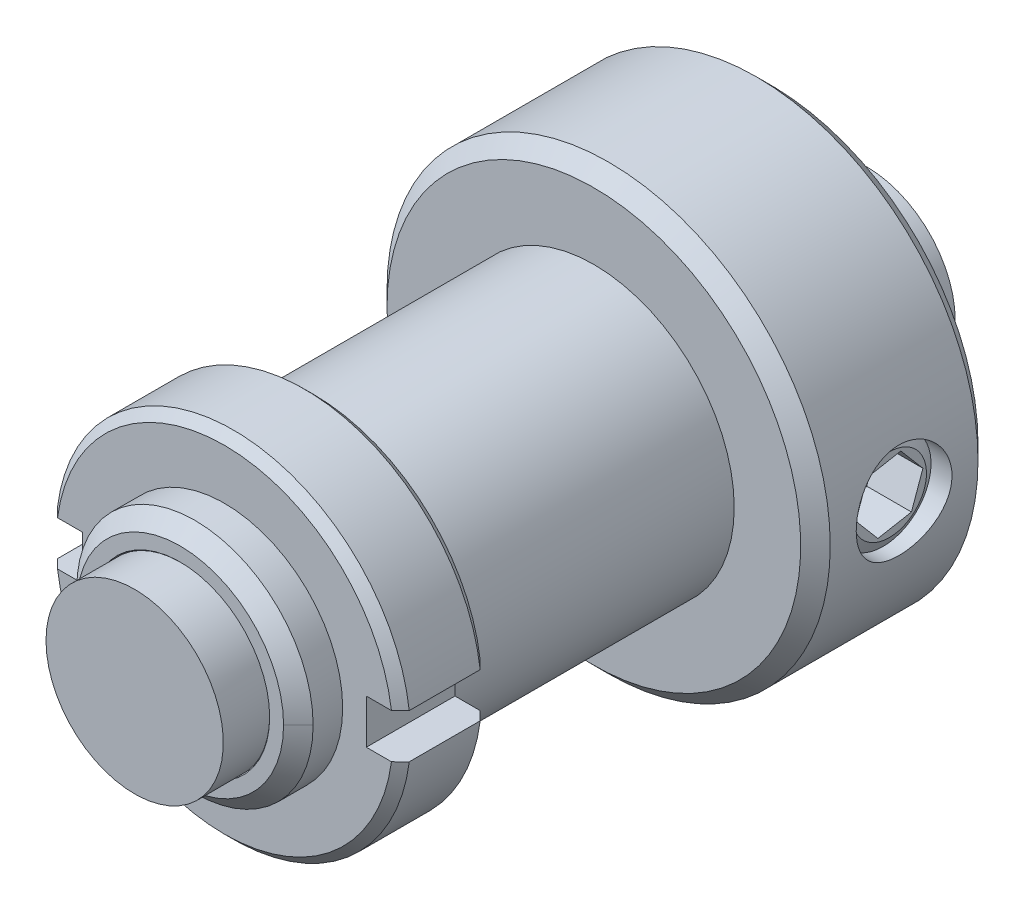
ISO-10303-21;
HEADER;
FILE_DESCRIPTION(('STEP AP214'),'2;1');
FILE_NAME('part.step','',(''),(''),'','','');
FILE_SCHEMA(('AUTOMOTIVE_DESIGN { 1 0 10303 214 1 1 1 1 }'));
ENDSEC;
DATA;
#1=APPLICATION_CONTEXT('core data for automotive mechanical design processes');
#2=APPLICATION_PROTOCOL_DEFINITION('international standard','automotive_design',2000,#1);
#3=PRODUCT_CONTEXT('',#1,'mechanical');
#4=PRODUCT('Part','Part','',(#3));
#5=PRODUCT_RELATED_PRODUCT_CATEGORY('part','',(#4));
#6=PRODUCT_DEFINITION_FORMATION('','',#4);
#7=PRODUCT_DEFINITION_CONTEXT('part definition',#1,'design');
#8=PRODUCT_DEFINITION('design','',#6,#7);
#9=PRODUCT_DEFINITION_SHAPE('','',#8);
#10=(LENGTH_UNIT() NAMED_UNIT(*) SI_UNIT(.MILLI.,.METRE.));
#11=(NAMED_UNIT(*) PLANE_ANGLE_UNIT() SI_UNIT($,.RADIAN.));
#12=(NAMED_UNIT(*) SI_UNIT($,.STERADIAN.) SOLID_ANGLE_UNIT());
#13=UNCERTAINTY_MEASURE_WITH_UNIT(LENGTH_MEASURE(1.E-05),#10,'distance_accuracy_value','');
#14=(GEOMETRIC_REPRESENTATION_CONTEXT(3) GLOBAL_UNCERTAINTY_ASSIGNED_CONTEXT((#13)) GLOBAL_UNIT_ASSIGNED_CONTEXT((#10,
#11,#12)) REPRESENTATION_CONTEXT('',''));
#15=CARTESIAN_POINT('',(0.,0.,0.));
#16=DIRECTION('',(0.,0.,1.));
#17=DIRECTION('',(1.,0.,0.));
#18=AXIS2_PLACEMENT_3D('',#15,#16,#17);
#19=CARTESIAN_POINT('',(-14.4175895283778,-2.21182835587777,2.71097354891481));
#20=DIRECTION('',(0.,0.,-1.));
#21=DIRECTION('',(-1.,0.,0.));
#22=AXIS2_PLACEMENT_3D('',#19,#20,#21);
#23=CONICAL_SURFACE('',#22,1.54999999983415,1.04719755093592);
#24=CARTESIAN_POINT('',(-14.4175895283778,-2.21182835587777,2.71097354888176));
#25=DIRECTION('',(0.,0.,-1.));
#26=DIRECTION('',(-1.,0.,0.));
#27=AXIS2_PLACEMENT_3D('',#24,#25,#26);
#28=CIRCLE('',#27,1.55);
#29=CARTESIAN_POINT('',(-15.9675895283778,-2.21182835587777,2.71097354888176));
#30=VERTEX_POINT('',#29);
#31=EDGE_CURVE('E424',#30,#30,#28,.T.);
#32=ORIENTED_EDGE('',*,*,#31,.T.);
#33=EDGE_LOOP('',(#32));
#34=FACE_BOUND('',#33,.T.);
#35=CARTESIAN_POINT('',(-14.4175895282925,-2.21182835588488,3.60586646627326));
#36=VERTEX_POINT('',#35);
#37=VERTEX_LOOP('',#36);
#38=FACE_BOUND('',#37,.T.);
#39=ADVANCED_FACE('F17',(#34,#38),#23,.F.);
#40=CARTESIAN_POINT('',(-14.4175895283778,-2.21182835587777,-1.28902645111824));
#41=DIRECTION('',(0.,0.,-1.));
#42=DIRECTION('',(-1.,0.,0.));
#43=AXIS2_PLACEMENT_3D('',#40,#41,#42);
#44=CYLINDRICAL_SURFACE('',#43,1.55);
#45=ORIENTED_EDGE('',*,*,#31,.F.);
#46=EDGE_LOOP('',(#45));
#47=FACE_BOUND('',#46,.T.);
#48=CARTESIAN_POINT('',(-14.4175895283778,-2.21182835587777,0.210973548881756));
#49=DIRECTION('',(0.,0.,-1.));
#50=DIRECTION('',(-1.,0.,0.));
#51=AXIS2_PLACEMENT_3D('',#48,#49,#50);
#52=CIRCLE('',#51,1.55);
#53=CARTESIAN_POINT('',(-13.014451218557,-1.5532671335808,0.210973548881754));
#54=VERTEX_POINT('',#53);
#55=CARTESIAN_POINT('',(-14.2863511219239,-0.667394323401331,0.210973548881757));
#56=VERTEX_POINT('',#55);
#57=EDGE_CURVE('E143',#54,#56,#52,.F.);
#58=ORIENTED_EDGE('',*,*,#57,.F.);
#59=CARTESIAN_POINT('',(-14.4175895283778,-2.21182835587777,0.210973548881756));
#60=DIRECTION('',(0.,0.,-1.));
#61=DIRECTION('',(-1.,0.,0.));
#62=AXIS2_PLACEMENT_3D('',#59,#60,#61);
#63=CIRCLE('',#62,1.55);
#64=CARTESIAN_POINT('',(-13.1456896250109,-3.09770116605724,0.210973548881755));
#65=VERTEX_POINT('',#64);
#66=EDGE_CURVE('E150',#65,#54,#63,.F.);
#67=ORIENTED_EDGE('',*,*,#66,.F.);
#68=CARTESIAN_POINT('',(-14.4175895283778,-2.21182835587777,0.210973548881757));
#69=DIRECTION('',(0.,0.,-1.));
#70=DIRECTION('',(-1.,0.,0.));
#71=AXIS2_PLACEMENT_3D('',#68,#69,#70);
#72=CIRCLE('',#71,1.55);
#73=CARTESIAN_POINT('',(-14.5488279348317,-3.75626238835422,0.210973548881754));
#74=VERTEX_POINT('',#73);
#75=EDGE_CURVE('E426',#74,#65,#72,.F.);
#76=ORIENTED_EDGE('',*,*,#75,.F.);
#77=CARTESIAN_POINT('',(-14.4175895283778,-2.21182835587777,0.210973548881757));
#78=DIRECTION('',(0.,0.,-1.));
#79=DIRECTION('',(-1.,0.,0.));
#80=AXIS2_PLACEMENT_3D('',#77,#78,#79);
#81=CIRCLE('',#80,1.55);
#82=CARTESIAN_POINT('',(-15.8207278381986,-2.87038957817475,0.210973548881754));
#83=VERTEX_POINT('',#82);
#84=EDGE_CURVE('E634',#83,#74,#81,.F.);
#85=ORIENTED_EDGE('',*,*,#84,.F.);
#86=CARTESIAN_POINT('',(-14.4175895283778,-2.21182835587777,0.210973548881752));
#87=DIRECTION('',(0.,0.,-1.));
#88=DIRECTION('',(-1.,0.,0.));
#89=AXIS2_PLACEMENT_3D('',#86,#87,#88);
#90=CIRCLE('',#89,1.55);
#91=CARTESIAN_POINT('',(-15.6894894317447,-1.32595554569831,0.210973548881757));
#92=VERTEX_POINT('',#91);
#93=EDGE_CURVE('E636',#92,#83,#90,.F.);
#94=ORIENTED_EDGE('',*,*,#93,.F.);
#95=CARTESIAN_POINT('',(-14.4175895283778,-2.21182835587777,0.210973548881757));
#96=DIRECTION('',(0.,0.,-1.));
#97=DIRECTION('',(-1.,0.,0.));
#98=AXIS2_PLACEMENT_3D('',#95,#96,#97);
#99=CIRCLE('',#98,1.55);
#100=EDGE_CURVE('E427',#56,#92,#99,.F.);
#101=ORIENTED_EDGE('',*,*,#100,.F.);
#102=EDGE_LOOP('',(#58,#67,#76,#85,#94,#101));
#103=FACE_BOUND('',#102,.T.);
#104=ADVANCED_FACE('F936',(#47,#103),#44,.F.);
#105=CARTESIAN_POINT('',(-14.4175895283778,-2.21182835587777,0.210973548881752));
#106=DIRECTION('',(0.,0.,-1.));
#107=DIRECTION('',(0.,1.,0.));
#108=AXIS2_PLACEMENT_3D('',#105,#106,#107);
#109=PLANE('',#108);
#110=DIRECTION('',(0.571530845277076,0.820580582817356,0.));
#111=VECTOR('',#110,1.);
#112=CARTESIAN_POINT('',(-12.634230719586,-2.3633694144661,0.210973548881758));
#113=LINE('',#112,#111);
#114=CARTESIAN_POINT('',(-13.6571485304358,-3.83203291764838,0.210973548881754));
#115=VERTEX_POINT('',#114);
#116=EDGE_CURVE('E364',#65,#115,#113,.F.);
#117=ORIENTED_EDGE('',*,*,#116,.T.);
#118=DIRECTION('',(0.996409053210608,-0.084669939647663,0.));
#119=VECTOR('',#118,1.);
#120=CARTESIAN_POINT('',(-13.6571485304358,-3.83203291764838,0.210973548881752));
#121=LINE('',#120,#119);
#122=EDGE_CURVE('E412',#115,#74,#121,.F.);
#123=ORIENTED_EDGE('',*,*,#122,.T.);
#124=ORIENTED_EDGE('',*,*,#75,.T.);
#125=EDGE_LOOP('',(#117,#123,#124));
#126=FACE_BOUND('',#125,.T.);
#127=ADVANCED_FACE('F614',(#126),#109,.T.);
#128=CARTESIAN_POINT('',(-14.4175895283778,-2.21182835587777,0.210973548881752));
#129=DIRECTION('',(0.,0.,-1.));
#130=DIRECTION('',(0.,1.,0.));
#131=AXIS2_PLACEMENT_3D('',#128,#129,#130);
#132=PLANE('',#131);
#133=DIRECTION('',(0.996409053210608,-0.084669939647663,0.));
#134=VECTOR('',#133,1.);
#135=CARTESIAN_POINT('',(-13.6571485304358,-3.83203291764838,0.210973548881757));
#136=LINE('',#135,#134);
#137=CARTESIAN_POINT('',(-15.4405073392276,-3.68049185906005,0.210973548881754));
#138=VERTEX_POINT('',#137);
#139=EDGE_CURVE('E409',#74,#138,#136,.F.);
#140=ORIENTED_EDGE('',*,*,#139,.T.);
#141=DIRECTION('',(0.424878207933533,-0.905250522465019,0.));
#142=VECTOR('',#141,1.);
#143=CARTESIAN_POINT('',(-15.4405073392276,-3.68049185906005,0.210973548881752));
#144=LINE('',#143,#142);
#145=EDGE_CURVE('E401',#138,#83,#144,.F.);
#146=ORIENTED_EDGE('',*,*,#145,.T.);
#147=ORIENTED_EDGE('',*,*,#84,.T.);
#148=EDGE_LOOP('',(#140,#146,#147));
#149=FACE_BOUND('',#148,.T.);
#150=ADVANCED_FACE('F632',(#149),#132,.T.);
#151=CARTESIAN_POINT('',(-14.4175895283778,-2.21182835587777,0.210973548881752));
#152=DIRECTION('',(0.,0.,-1.));
#153=DIRECTION('',(0.,1.,0.));
#154=AXIS2_PLACEMENT_3D('',#151,#152,#153);
#155=PLANE('',#154);
#156=DIRECTION('',(-0.571530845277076,-0.820580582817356,0.));
#157=VECTOR('',#156,1.);
#158=CARTESIAN_POINT('',(-16.2009483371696,-2.06028729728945,0.210973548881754));
#159=LINE('',#158,#157);
#160=CARTESIAN_POINT('',(-16.2009483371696,-2.06028729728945,0.210973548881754));
#161=VERTEX_POINT('',#160);
#162=EDGE_CURVE('E390',#161,#92,#159,.F.);
#163=ORIENTED_EDGE('',*,*,#162,.T.);
#164=ORIENTED_EDGE('',*,*,#93,.T.);
#165=DIRECTION('',(0.424878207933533,-0.905250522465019,0.));
#166=VECTOR('',#165,1.);
#167=CARTESIAN_POINT('',(-15.4405073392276,-3.68049185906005,0.210973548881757));
#168=LINE('',#167,#166);
#169=EDGE_CURVE('E398',#83,#161,#168,.F.);
#170=ORIENTED_EDGE('',*,*,#169,.T.);
#171=EDGE_LOOP('',(#163,#164,#170));
#172=FACE_BOUND('',#171,.T.);
#173=ADVANCED_FACE('F924',(#172),#155,.T.);
#174=CARTESIAN_POINT('',(-14.4175895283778,-2.21182835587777,0.210973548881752));
#175=DIRECTION('',(0.,0.,-1.));
#176=DIRECTION('',(0.,1.,0.));
#177=AXIS2_PLACEMENT_3D('',#174,#175,#176);
#178=PLANE('',#177);
#179=DIRECTION('',(-0.571530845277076,-0.820580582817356,0.));
#180=VECTOR('',#179,1.);
#181=CARTESIAN_POINT('',(-16.2009483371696,-2.06028729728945,0.210973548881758));
#182=LINE('',#181,#180);
#183=CARTESIAN_POINT('',(-15.1780305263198,-0.591623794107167,0.210973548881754));
#184=VERTEX_POINT('',#183);
#185=EDGE_CURVE('E387',#92,#184,#182,.F.);
#186=ORIENTED_EDGE('',*,*,#185,.T.);
#187=DIRECTION('',(-0.996409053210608,0.0846699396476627,0.));
#188=VECTOR('',#187,1.);
#189=CARTESIAN_POINT('',(-15.1780305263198,-0.591623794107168,0.210973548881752));
#190=LINE('',#189,#188);
#191=EDGE_CURVE('E379',#184,#56,#190,.F.);
#192=ORIENTED_EDGE('',*,*,#191,.T.);
#193=ORIENTED_EDGE('',*,*,#100,.T.);
#194=EDGE_LOOP('',(#186,#192,#193));
#195=FACE_BOUND('',#194,.T.);
#196=ADVANCED_FACE('F920',(#195),#178,.T.);
#197=CARTESIAN_POINT('',(-14.4175895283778,-2.21182835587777,0.210973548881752));
#198=DIRECTION('',(0.,0.,-1.));
#199=DIRECTION('',(0.,1.,0.));
#200=AXIS2_PLACEMENT_3D('',#197,#198,#199);
#201=PLANE('',#200);
#202=DIRECTION('',(-0.996409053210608,0.0846699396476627,0.));
#203=VECTOR('',#202,1.);
#204=CARTESIAN_POINT('',(-15.1780305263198,-0.591623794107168,0.210973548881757));
#205=LINE('',#204,#203);
#206=CARTESIAN_POINT('',(-13.394671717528,-0.743164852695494,0.210973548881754));
#207=VERTEX_POINT('',#206);
#208=EDGE_CURVE('E377',#56,#207,#205,.F.);
#209=ORIENTED_EDGE('',*,*,#208,.T.);
#210=DIRECTION('',(-0.424878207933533,0.905250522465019,0.));
#211=VECTOR('',#210,1.);
#212=CARTESIAN_POINT('',(-13.394671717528,-0.743164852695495,0.210973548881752));
#213=LINE('',#212,#211);
#214=EDGE_CURVE('E370',#207,#54,#213,.F.);
#215=ORIENTED_EDGE('',*,*,#214,.T.);
#216=ORIENTED_EDGE('',*,*,#57,.T.);
#217=EDGE_LOOP('',(#209,#215,#216));
#218=FACE_BOUND('',#217,.T.);
#219=ADVANCED_FACE('F916',(#218),#201,.T.);
#220=CARTESIAN_POINT('',(-14.4175895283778,-2.21182835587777,0.210973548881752));
#221=DIRECTION('',(0.,0.,-1.));
#222=DIRECTION('',(0.,1.,0.));
#223=AXIS2_PLACEMENT_3D('',#220,#221,#222);
#224=PLANE('',#223);
#225=DIRECTION('',(0.571530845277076,0.820580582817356,0.));
#226=VECTOR('',#225,1.);
#227=CARTESIAN_POINT('',(-12.634230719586,-2.3633694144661,0.210973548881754));
#228=LINE('',#227,#226);
#229=CARTESIAN_POINT('',(-12.634230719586,-2.3633694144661,0.210973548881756));
#230=VERTEX_POINT('',#229);
#231=EDGE_CURVE('E362',#230,#65,#228,.F.);
#232=ORIENTED_EDGE('',*,*,#231,.T.);
#233=ORIENTED_EDGE('',*,*,#66,.T.);
#234=DIRECTION('',(-0.424878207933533,0.905250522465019,0.));
#235=VECTOR('',#234,1.);
#236=CARTESIAN_POINT('',(-13.394671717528,-0.743164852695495,0.210973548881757));
#237=LINE('',#236,#235);
#238=EDGE_CURVE('E367',#54,#230,#237,.F.);
#239=ORIENTED_EDGE('',*,*,#238,.T.);
#240=EDGE_LOOP('',(#232,#233,#239));
#241=FACE_BOUND('',#240,.T.);
#242=ADVANCED_FACE('F911',(#241),#224,.T.);
#243=CARTESIAN_POINT('',(-14.2905846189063,-0.717214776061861,19.7109735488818));
#244=DIRECTION('',(0.,0.,1.));
#245=DIRECTION('',(0.,-1.,0.));
#246=AXIS2_PLACEMENT_3D('',#243,#244,#245);
#247=PLANE('',#246);
#248=CARTESIAN_POINT('',(-14.4175895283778,-2.21182835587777,19.7109735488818));
#249=DIRECTION('',(0.,0.,-1.));
#250=DIRECTION('',(-1.,0.,0.));
#251=AXIS2_PLACEMENT_3D('',#248,#249,#250);
#252=CIRCLE('',#251,3.);
#253=CARTESIAN_POINT('',(-17.4175895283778,-2.21182835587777,19.7109735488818));
#254=VERTEX_POINT('',#253);
#255=EDGE_CURVE('E694',#254,#254,#252,.T.);
#256=ORIENTED_EDGE('',*,*,#255,.F.);
#257=EDGE_LOOP('',(#256));
#258=FACE_BOUND('',#257,.T.);
#259=ADVANCED_FACE('F907',(#258),#247,.T.);
#260=CARTESIAN_POINT('',(-12.634230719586,-2.3633694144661,-5.28902645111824));
#261=DIRECTION('',(0.820580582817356,-0.571530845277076,0.));
#262=DIRECTION('',(0.571530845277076,0.820580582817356,0.));
#263=AXIS2_PLACEMENT_3D('',#260,#261,#262);
#264=PLANE('',#263);
#265=DIRECTION('',(0.,0.,1.));
#266=VECTOR('',#265,1.);
#267=CARTESIAN_POINT('',(-13.6571485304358,-3.83203291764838,-5.28902645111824));
#268=LINE('',#267,#266);
#269=CARTESIAN_POINT('',(-13.657148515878,-3.8320328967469,-4.49191211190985));
#270=VERTEX_POINT('',#269);
#271=EDGE_CURVE('E417',#270,#115,#268,.T.);
#272=ORIENTED_EDGE('',*,*,#271,.T.);
#273=ORIENTED_EDGE('',*,*,#116,.F.);
#274=ORIENTED_EDGE('',*,*,#231,.F.);
#275=DIRECTION('',(0.,0.,1.));
#276=VECTOR('',#275,1.);
#277=CARTESIAN_POINT('',(-12.634230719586,-2.3633694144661,-5.28902645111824));
#278=LINE('',#277,#276);
#279=CARTESIAN_POINT('',(-12.6342307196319,-2.3633694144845,-4.49191213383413));
#280=VERTEX_POINT('',#279);
#281=EDGE_CURVE('E369',#230,#280,#278,.F.);
#282=ORIENTED_EDGE('',*,*,#281,.T.);
#283=CARTESIAN_POINT('',(-12.6342307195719,-2.36336941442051,-4.4919121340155));
#284=CARTESIAN_POINT('',(-12.6556318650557,-2.39409630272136,-4.459522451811));
#285=CARTESIAN_POINT('',(-12.6774610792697,-2.42543779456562,-4.42793543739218));
#286=CARTESIAN_POINT('',(-12.7222514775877,-2.48974601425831,-4.36688592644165));
#287=CARTESIAN_POINT('',(-12.7452180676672,-2.52272050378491,-4.33743563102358));
#288=CARTESIAN_POINT('',(-12.7929432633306,-2.59124238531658,-4.28081606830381));
#289=CARTESIAN_POINT('',(-12.8177328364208,-2.62683423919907,-4.25372538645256));
#290=CARTESIAN_POINT('',(-12.8686423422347,-2.69992802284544,-4.20387156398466));
#291=CARTESIAN_POINT('',(-12.8947591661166,-2.73742548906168,-4.18109885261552));
#292=CARTESIAN_POINT('',(-12.9507691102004,-2.81784227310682,-4.13947730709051));
#293=CARTESIAN_POINT('',(-12.9807925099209,-2.86094864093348,-4.12114803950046));
#294=CARTESIAN_POINT('',(-13.0419414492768,-2.94874378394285,-4.09340602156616));
#295=CARTESIAN_POINT('',(-13.073055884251,-2.99341661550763,-4.08392112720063));
#296=CARTESIAN_POINT('',(-13.1360572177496,-3.08387135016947,-4.0750455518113));
#297=CARTESIAN_POINT('',(-13.1679485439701,-3.12965961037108,-4.07574628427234));
#298=CARTESIAN_POINT('',(-13.2311704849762,-3.22043108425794,-4.08735384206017));
#299=CARTESIAN_POINT('',(-13.2624994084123,-3.26541186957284,-4.09828744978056));
#300=CARTESIAN_POINT('',(-13.3325784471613,-3.36602848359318,-4.13313896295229));
#301=CARTESIAN_POINT('',(-13.3708530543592,-3.42098159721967,-4.15989839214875));
#302=CARTESIAN_POINT('',(-13.4446956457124,-3.52700176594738,-4.22333606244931));
#303=CARTESIAN_POINT('',(-13.4802499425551,-3.57804916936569,-4.26006071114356));
#304=CARTESIAN_POINT('',(-13.5396630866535,-3.66335212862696,-4.32927474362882));
#305=CARTESIAN_POINT('',(-13.5641076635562,-3.69844865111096,-4.3602719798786));
#306=CARTESIAN_POINT('',(-13.6115663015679,-3.76658782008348,-4.42453903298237));
#307=CARTESIAN_POINT('',(-13.6345934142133,-3.79964920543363,-4.45777918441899));
#308=CARTESIAN_POINT('',(-13.6571485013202,-3.83203287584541,-4.49191208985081));
#309=B_SPLINE_CURVE_WITH_KNOTS('',3,(#283,#284,#285,#286,#287,#288,#289,#290,#291,#292,#293,
#294,#295,#296,#297,#298,#299,#300,#301,#302,#303,#304,#305,#306,#307,#308),.UNSPECIFIED.,.F.,
.F.,(4,2,2,2,2,2,2,2,2,2,2,2,4),(0.,0.148579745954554,0.297950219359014,0.451179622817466,
0.604065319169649,0.77036470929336,0.935295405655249,1.10170722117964,1.26855580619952,
1.48367993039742,1.69982360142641,1.85818808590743,2.01476160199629),.UNSPECIFIED.);
#310=EDGE_CURVE('E622',#280,#270,#309,.T.);
#311=ORIENTED_EDGE('',*,*,#310,.T.);
#312=EDGE_LOOP('',(#272,#273,#274,#282,#311));
#313=FACE_BOUND('',#312,.T.);
#314=ADVANCED_FACE('F620',(#313),#264,.F.);
#315=CARTESIAN_POINT('',(-13.6571485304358,-3.83203291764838,-5.28902645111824));
#316=DIRECTION('',(-0.084669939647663,-0.996409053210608,0.));
#317=DIRECTION('',(0.996409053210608,-0.084669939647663,0.));
#318=AXIS2_PLACEMENT_3D('',#315,#316,#317);
#319=PLANE('',#318);
#320=DIRECTION('',(0.,0.,1.));
#321=VECTOR('',#320,1.);
#322=CARTESIAN_POINT('',(-15.4405073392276,-3.68049185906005,-5.28902645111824));
#323=LINE('',#322,#321);
#324=CARTESIAN_POINT('',(-15.4405073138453,-3.68049186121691,-4.49191211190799));
#325=VERTEX_POINT('',#324);
#326=EDGE_CURVE('E406',#325,#138,#323,.T.);
#327=ORIENTED_EDGE('',*,*,#326,.T.);
#328=ORIENTED_EDGE('',*,*,#139,.F.);
#329=ORIENTED_EDGE('',*,*,#122,.F.);
#330=ORIENTED_EDGE('',*,*,#271,.F.);
#331=CARTESIAN_POINT('',(-13.6571485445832,-3.8320329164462,-4.49191212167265));
#332=CARTESIAN_POINT('',(-13.6944593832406,-3.82886242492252,-4.45952243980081));
#333=CARTESIAN_POINT('',(-13.7325165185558,-3.82562851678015,-4.42793542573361));
#334=CARTESIAN_POINT('',(-13.810604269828,-3.81899300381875,-4.36688591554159));
#335=CARTESIAN_POINT('',(-13.8506443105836,-3.81559059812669,-4.33743562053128));
#336=CARTESIAN_POINT('',(-13.9338485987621,-3.80852030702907,-4.28081605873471));
#337=CARTESIAN_POINT('',(-13.9770668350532,-3.80484783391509,-4.25372537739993));
#338=CARTESIAN_POINT('',(-14.0658226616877,-3.79730580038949,-4.20387155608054));
#339=CARTESIAN_POINT('',(-14.1113548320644,-3.79343670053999,-4.18109884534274));
#340=CARTESIAN_POINT('',(-14.209002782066,-3.78513905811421,-4.13947730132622));
#341=CARTESIAN_POINT('',(-14.2613456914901,-3.78069121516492,-4.12114803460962));
#342=CARTESIAN_POINT('',(-14.3679529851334,-3.7716322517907,-4.09340601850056));
#343=CARTESIAN_POINT('',(-14.4221980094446,-3.76702277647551,-4.08392112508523));
#344=CARTESIAN_POINT('',(-14.5320347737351,-3.75768938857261,-4.07504555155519));
#345=CARTESIAN_POINT('',(-14.5876342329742,-3.75296482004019,-4.07574628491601));
#346=CARTESIAN_POINT('',(-14.6978556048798,-3.74359875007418,-4.08735384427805));
#347=CARTESIAN_POINT('',(-14.7524745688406,-3.73895749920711,-4.09828745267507));
#348=CARTESIAN_POINT('',(-14.8746506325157,-3.72857557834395,-4.13313896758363));
#349=CARTESIAN_POINT('',(-14.9413787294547,-3.72290535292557,-4.15989839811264));
#350=CARTESIAN_POINT('',(-15.0701161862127,-3.71196587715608,-4.22333607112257));
#351=CARTESIAN_POINT('',(-15.1321016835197,-3.70669865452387,-4.26006072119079));
#352=CARTESIAN_POINT('',(-15.2356827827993,-3.69789684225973,-4.32927475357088));
#353=CARTESIAN_POINT('',(-15.2782995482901,-3.69427547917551,-4.36027198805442));
#354=CARTESIAN_POINT('',(-15.3610391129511,-3.68724467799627,-4.42453903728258));
#355=CARTESIAN_POINT('',(-15.4011846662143,-3.68383330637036,-4.45777918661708));
#356=CARTESIAN_POINT('',(-15.4405072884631,-3.68049186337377,-4.4919120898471));
#357=B_SPLINE_CURVE_WITH_KNOTS('',3,(#331,#332,#333,#334,#335,#336,#337,#338,#339,#340,#341,
#342,#343,#344,#345,#346,#347,#348,#349,#350,#351,#352,#353,#354,#355,#356),.UNSPECIFIED.,.F.,
.F.,(4,2,2,2,2,2,2,2,2,2,2,2,4),(0.,0.148579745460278,0.297950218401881,0.451179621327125,
0.604065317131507,0.770364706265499,0.935295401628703,1.10170721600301,1.26855579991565,
1.48367992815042,1.6998236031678,1.85818807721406,2.01476158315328),.UNSPECIFIED.);
#358=EDGE_CURVE('E952',#270,#325,#357,.T.);
#359=ORIENTED_EDGE('',*,*,#358,.T.);
#360=EDGE_LOOP('',(#327,#328,#329,#330,#359));
#361=FACE_BOUND('',#360,.T.);
#362=ADVANCED_FACE('F628',(#361),#319,.F.);
#363=CARTESIAN_POINT('',(-15.4405073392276,-3.68049185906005,-5.28902645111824));
#364=DIRECTION('',(-0.905250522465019,-0.424878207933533,0.));
#365=DIRECTION('',(0.424878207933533,-0.905250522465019,0.));
#366=AXIS2_PLACEMENT_3D('',#363,#364,#365);
#367=PLANE('',#366);
#368=DIRECTION('',(0.,0.,1.));
#369=VECTOR('',#368,1.);
#370=CARTESIAN_POINT('',(-16.2009483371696,-2.06028729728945,-5.28902645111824));
#371=LINE('',#370,#369);
#372=CARTESIAN_POINT('',(-16.200948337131,-2.06028729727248,-4.49191213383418));
#373=VERTEX_POINT('',#372);
#374=EDGE_CURVE('E395',#373,#161,#371,.T.);
#375=ORIENTED_EDGE('',*,*,#374,.T.);
#376=ORIENTED_EDGE('',*,*,#169,.F.);
#377=ORIENTED_EDGE('',*,*,#145,.F.);
#378=ORIENTED_EDGE('',*,*,#326,.F.);
#379=CARTESIAN_POINT('',(-15.4405073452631,-3.68049184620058,-4.49191212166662));
#380=CARTESIAN_POINT('',(-15.4564170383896,-3.64659446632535,-4.45952243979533));
#381=CARTESIAN_POINT('',(-15.4726449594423,-3.61201906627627,-4.42793542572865));
#382=CARTESIAN_POINT('',(-15.5059423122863,-3.54107533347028,-4.36688591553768));
#383=CARTESIAN_POINT('',(-15.5230157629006,-3.50469843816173,-4.33743562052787));
#384=CARTESIAN_POINT('',(-15.5584948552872,-3.42910626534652,-4.2808160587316));
#385=CARTESIAN_POINT('',(-15.5769235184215,-3.38984193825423,-4.2537253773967));
#386=CARTESIAN_POINT('',(-15.6147698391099,-3.30920612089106,-4.20387155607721));
#387=CARTESIAN_POINT('',(-15.634185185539,-3.26783955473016,-4.18109884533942));
#388=CARTESIAN_POINT('',(-15.6758231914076,-3.17912512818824,-4.13947730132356));
#389=CARTESIAN_POINT('',(-15.6981427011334,-3.13157091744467,-4.12114803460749));
#390=CARTESIAN_POINT('',(-15.743601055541,-3.03471681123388,-4.09340601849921));
#391=CARTESIAN_POINT('',(-15.7667316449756,-2.98543450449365,-4.08392112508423));
#392=CARTESIAN_POINT('',(-15.813567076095,-2.88564638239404,-4.07504555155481));
#393=CARTESIAN_POINT('',(-15.8372752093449,-2.8351335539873,-4.07574628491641));
#394=CARTESIAN_POINT('',(-15.8842746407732,-2.73499601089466,-4.08735384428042));
#395=CARTESIAN_POINT('',(-15.9075646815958,-2.68537397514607,-4.09828745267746));
#396=CARTESIAN_POINT('',(-15.9596617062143,-2.57437543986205,-4.13313896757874));
#397=CARTESIAN_POINT('',(-15.9881151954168,-2.51375210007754,-4.15989839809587));
#398=CARTESIAN_POINT('',(-16.0430100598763,-2.39679245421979,-4.22333607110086));
#399=CARTESIAN_POINT('',(-16.0694412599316,-2.34047782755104,-4.26006072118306));
#400=CARTESIAN_POINT('',(-16.113609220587,-2.24637304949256,-4.3292747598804));
#401=CARTESIAN_POINT('',(-16.1317814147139,-2.20765515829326,-4.36027200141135));
#402=CARTESIAN_POINT('',(-16.1670623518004,-2.13248517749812,-4.42453906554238));
#403=CARTESIAN_POINT('',(-16.1841807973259,-2.09601241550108,-4.45777922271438));
#404=CARTESIAN_POINT('',(-16.2009483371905,-2.06028729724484,-4.49191213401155));
#405=B_SPLINE_CURVE_WITH_KNOTS('',3,(#379,#380,#381,#382,#383,#384,#385,#386,#387,#388,#389,
#390,#391,#392,#393,#394,#395,#396,#397,#398,#399,#400,#401,#402,#403,#404),.UNSPECIFIED.,.F.,
.F.,(4,2,2,2,2,2,2,2,2,2,2,2,4),(0.,0.148579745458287,0.297950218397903,0.451179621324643,
0.604065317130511,0.770364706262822,0.935295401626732,1.10170721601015,1.26855579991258,
1.48367992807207,1.69982360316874,1.85818811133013,2.01476165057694),.UNSPECIFIED.);
#406=EDGE_CURVE('E969',#325,#373,#405,.T.);
#407=ORIENTED_EDGE('',*,*,#406,.T.);
#408=EDGE_LOOP('',(#375,#376,#377,#378,#407));
#409=FACE_BOUND('',#408,.T.);
#410=ADVANCED_FACE('F895',(#409),#367,.F.);
#411=CARTESIAN_POINT('',(-16.2009483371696,-2.06028729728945,-5.28902645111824));
#412=DIRECTION('',(-0.820580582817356,0.571530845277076,0.));
#413=DIRECTION('',(-0.571530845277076,-0.820580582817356,0.));
#414=AXIS2_PLACEMENT_3D('',#411,#412,#413);
#415=PLANE('',#414);
#416=DIRECTION('',(0.,0.,1.));
#417=VECTOR('',#416,1.);
#418=CARTESIAN_POINT('',(-15.1780305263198,-0.591623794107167,-5.28902645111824));
#419=LINE('',#418,#417);
#420=CARTESIAN_POINT('',(-15.1780305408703,-0.591623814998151,-4.49191211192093));
#421=VERTEX_POINT('',#420);
#422=EDGE_CURVE('E384',#421,#184,#419,.T.);
#423=ORIENTED_EDGE('',*,*,#422,.T.);
#424=ORIENTED_EDGE('',*,*,#185,.F.);
#425=ORIENTED_EDGE('',*,*,#162,.F.);
#426=ORIENTED_EDGE('',*,*,#374,.F.);
#427=CARTESIAN_POINT('',(-16.2009483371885,-2.06028729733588,-4.49191213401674));
#428=CARTESIAN_POINT('',(-16.1795471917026,-2.02956040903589,-4.45952245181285));
#429=CARTESIAN_POINT('',(-16.1577179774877,-1.99821891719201,-4.42793543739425));
#430=CARTESIAN_POINT('',(-16.1129275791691,-1.93391069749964,-4.36688592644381));
#431=CARTESIAN_POINT('',(-16.0899609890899,-1.90093620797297,-4.33743563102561));
#432=CARTESIAN_POINT('',(-16.0422357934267,-1.83241432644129,-4.28081606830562));
#433=CARTESIAN_POINT('',(-16.0174462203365,-1.79682247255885,-4.2537253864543));
#434=CARTESIAN_POINT('',(-15.9665367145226,-1.72372868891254,-4.2038715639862));
#435=CARTESIAN_POINT('',(-15.9404198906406,-1.68623122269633,-4.18109885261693));
#436=CARTESIAN_POINT('',(-15.8844099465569,-1.6058144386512,-4.13947730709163));
#437=CARTESIAN_POINT('',(-15.8543865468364,-1.56270807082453,-4.1211480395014));
#438=CARTESIAN_POINT('',(-15.7932376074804,-1.47491292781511,-4.09340602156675));
#439=CARTESIAN_POINT('',(-15.7621231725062,-1.4302400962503,-4.08392112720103));
#440=CARTESIAN_POINT('',(-15.6991218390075,-1.33978536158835,-4.07504555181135));
#441=CARTESIAN_POINT('',(-15.667230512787,-1.29399710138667,-4.07574628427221));
#442=CARTESIAN_POINT('',(-15.6040085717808,-1.20322562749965,-4.08735384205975));
#443=CARTESIAN_POINT('',(-15.5726796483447,-1.15824484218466,-4.09828744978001));
#444=CARTESIAN_POINT('',(-15.5026006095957,-1.05762822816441,-4.13313896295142));
#445=CARTESIAN_POINT('',(-15.4643260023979,-1.00267511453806,-4.15989839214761));
#446=CARTESIAN_POINT('',(-15.3904834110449,-0.896654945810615,-4.22333606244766));
#447=CARTESIAN_POINT('',(-15.3549291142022,-0.845607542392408,-4.26006071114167));
#448=CARTESIAN_POINT('',(-15.2955159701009,-0.760304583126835,-4.32927474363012));
#449=CARTESIAN_POINT('',(-15.2710713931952,-0.725208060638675,-4.36027197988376));
#450=CARTESIAN_POINT('',(-15.2236127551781,-0.657068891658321,-4.42453903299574));
#451=CARTESIAN_POINT('',(-15.2005856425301,-0.624007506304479,-4.45777918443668));
#452=CARTESIAN_POINT('',(-15.1780305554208,-0.591623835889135,-4.49191208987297));
#453=B_SPLINE_CURVE_WITH_KNOTS('',3,(#427,#428,#429,#430,#431,#432,#433,#434,#435,#436,#437,
#438,#439,#440,#441,#442,#443,#444,#445,#446,#447,#448,#449,#450,#451,#452),.UNSPECIFIED.,.F.,
.F.,(4,2,2,2,2,2,2,2,2,2,2,2,4),(0.,0.148579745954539,0.297950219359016,0.451179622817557,
0.604065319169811,0.770364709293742,0.935295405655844,1.10170722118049,1.2685558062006,
1.48367993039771,1.69982360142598,1.85818808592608,2.01476160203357),.UNSPECIFIED.);
#454=EDGE_CURVE('E984',#373,#421,#453,.T.);
#455=ORIENTED_EDGE('',*,*,#454,.T.);
#456=EDGE_LOOP('',(#423,#424,#425,#426,#455));
#457=FACE_BOUND('',#456,.T.);
#458=ADVANCED_FACE('F890',(#457),#415,.F.);
#459=CARTESIAN_POINT('',(-15.1780305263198,-0.591623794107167,-5.28902645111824));
#460=DIRECTION('',(0.0846699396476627,0.996409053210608,0.));
#461=DIRECTION('',(-0.996409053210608,0.0846699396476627,0.));
#462=AXIS2_PLACEMENT_3D('',#459,#460,#461);
#463=PLANE('',#462);
#464=DIRECTION('',(0.,0.,1.));
#465=VECTOR('',#464,1.);
#466=CARTESIAN_POINT('',(-13.394671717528,-0.743164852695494,-5.28902645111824));
#467=LINE('',#466,#465);
#468=CARTESIAN_POINT('',(-13.3946717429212,-0.743164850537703,-4.49191211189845));
#469=VERTEX_POINT('',#468);
#470=EDGE_CURVE('E374',#469,#207,#467,.T.);
#471=ORIENTED_EDGE('',*,*,#470,.T.);
#472=ORIENTED_EDGE('',*,*,#208,.F.);
#473=ORIENTED_EDGE('',*,*,#191,.F.);
#474=ORIENTED_EDGE('',*,*,#422,.F.);
#475=CARTESIAN_POINT('',(-15.1780305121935,-0.591623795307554,-4.49191212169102));
#476=CARTESIAN_POINT('',(-15.1407196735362,-0.594794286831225,-4.4595224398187));
#477=CARTESIAN_POINT('',(-15.1026625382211,-0.598028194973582,-4.42793542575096));
#478=CARTESIAN_POINT('',(-15.0245747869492,-0.604663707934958,-4.36688591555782));
#479=CARTESIAN_POINT('',(-14.9845347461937,-0.608066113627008,-4.3374356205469));
#480=CARTESIAN_POINT('',(-14.9013304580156,-0.615136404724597,-4.28081605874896));
#481=CARTESIAN_POINT('',(-14.8581122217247,-0.618808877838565,-4.25372537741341));
#482=CARTESIAN_POINT('',(-14.7693563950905,-0.626350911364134,-4.20387155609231));
#483=CARTESIAN_POINT('',(-14.723824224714,-0.630220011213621,-4.18109884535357));
#484=CARTESIAN_POINT('',(-14.6261762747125,-0.63851765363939,-4.13947730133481));
#485=CARTESIAN_POINT('',(-14.5738333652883,-0.642965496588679,-4.1211480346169));
#486=CARTESIAN_POINT('',(-14.4672260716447,-0.652024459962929,-4.09340601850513));
#487=CARTESIAN_POINT('',(-14.4129810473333,-0.656633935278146,-4.08392112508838));
#488=CARTESIAN_POINT('',(-14.3031442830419,-0.665967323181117,-4.07504555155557));
#489=CARTESIAN_POINT('',(-14.2475448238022,-0.670691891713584,-4.07574628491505));
#490=CARTESIAN_POINT('',(-14.1373234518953,-0.680057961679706,-4.08735384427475));
#491=CARTESIAN_POINT('',(-14.0827044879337,-0.684699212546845,-4.09828745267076));
#492=CARTESIAN_POINT('',(-13.9605284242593,-0.69508113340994,-4.13313896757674));
#493=CARTESIAN_POINT('',(-13.8938003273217,-0.700751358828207,-4.15989839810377));
#494=CARTESIAN_POINT('',(-13.7650628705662,-0.711690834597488,-4.22333607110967));
#495=CARTESIAN_POINT('',(-13.7030773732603,-0.716958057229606,-4.26006072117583));
#496=CARTESIAN_POINT('',(-13.599496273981,-0.725759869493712,-4.32927475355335));
#497=CARTESIAN_POINT('',(-13.5568795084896,-0.729381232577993,-4.36027198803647));
#498=CARTESIAN_POINT('',(-13.4741399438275,-0.736412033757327,-4.42453903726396));
#499=CARTESIAN_POINT('',(-13.4339943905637,-0.739823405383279,-4.45777918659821));
#500=CARTESIAN_POINT('',(-13.3946717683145,-0.743164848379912,-4.49191208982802));
#501=B_SPLINE_CURVE_WITH_KNOTS('',3,(#475,#476,#477,#478,#479,#480,#481,#482,#483,#484,#485,
#486,#487,#488,#489,#490,#491,#492,#493,#494,#495,#496,#497,#498,#499,#500),.UNSPECIFIED.,.F.,
.F.,(4,2,2,2,2,2,2,2,2,2,2,2,4),(0.,0.148579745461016,0.297950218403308,0.451179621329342,
0.604065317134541,0.770364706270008,0.935295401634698,1.10170721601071,1.26855579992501,
1.4836799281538,1.6998236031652,1.85818807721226,2.01476158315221),.UNSPECIFIED.);
#502=EDGE_CURVE('E961',#421,#469,#501,.T.);
#503=ORIENTED_EDGE('',*,*,#502,.T.);
#504=EDGE_LOOP('',(#471,#472,#473,#474,#503));
#505=FACE_BOUND('',#504,.T.);
#506=ADVANCED_FACE('F885',(#505),#463,.F.);
#507=CARTESIAN_POINT('',(-13.394671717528,-0.743164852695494,-5.28902645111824));
#508=DIRECTION('',(0.905250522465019,0.424878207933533,0.));
#509=DIRECTION('',(-0.424878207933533,0.905250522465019,0.));
#510=AXIS2_PLACEMENT_3D('',#507,#508,#509);
#511=PLANE('',#510);
#512=ORIENTED_EDGE('',*,*,#281,.F.);
#513=ORIENTED_EDGE('',*,*,#238,.F.);
#514=ORIENTED_EDGE('',*,*,#214,.F.);
#515=ORIENTED_EDGE('',*,*,#470,.F.);
#516=CARTESIAN_POINT('',(-13.3946717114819,-0.743164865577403,-4.49191212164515));
#517=CARTESIAN_POINT('',(-13.3787620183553,-0.77706224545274,-4.45952243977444));
#518=CARTESIAN_POINT('',(-13.3625340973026,-0.811637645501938,-4.42793542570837));
#519=CARTESIAN_POINT('',(-13.3292367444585,-0.882581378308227,-4.36688591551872));
#520=CARTESIAN_POINT('',(-13.3121632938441,-0.91895827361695,-4.33743562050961));
#521=CARTESIAN_POINT('',(-13.2766842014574,-0.994550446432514,-4.28081605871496));
#522=CARTESIAN_POINT('',(-13.258255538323,-1.03381477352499,-4.25372537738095));
#523=CARTESIAN_POINT('',(-13.2204092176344,-1.11445059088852,-4.20387155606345));
#524=CARTESIAN_POINT('',(-13.2009938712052,-1.1558171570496,-4.18109884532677));
#525=CARTESIAN_POINT('',(-13.1593558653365,-1.24453158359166,-4.13947730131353));
#526=CARTESIAN_POINT('',(-13.1370363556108,-1.29208579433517,-4.12114803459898));
#527=CARTESIAN_POINT('',(-13.0915780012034,-1.38893990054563,-4.09340601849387));
#528=CARTESIAN_POINT('',(-13.0684474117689,-1.43822220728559,-4.08392112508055));
#529=CARTESIAN_POINT('',(-13.0216119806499,-1.5380103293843,-4.07504555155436));
#530=CARTESIAN_POINT('',(-12.9979038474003,-1.58852315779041,-4.07574628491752));
#531=CARTESIAN_POINT('',(-12.9509044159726,-1.68866070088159,-4.08735384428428));
#532=CARTESIAN_POINT('',(-12.9276143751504,-1.73828273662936,-4.09828745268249));
#533=CARTESIAN_POINT('',(-12.8755173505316,-1.84928127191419,-4.1331389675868));
#534=CARTESIAN_POINT('',(-12.8470638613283,-1.90990461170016,-4.15989839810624));
#535=CARTESIAN_POINT('',(-12.7921689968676,-2.02686425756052,-4.22333607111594));
#536=CARTESIAN_POINT('',(-12.7657377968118,-2.08317888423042,-4.26006072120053));
#537=CARTESIAN_POINT('',(-12.7215698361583,-2.17728366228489,-4.32927475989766));
#538=CARTESIAN_POINT('',(-12.7033976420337,-2.21600155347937,-4.36027200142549));
#539=CARTESIAN_POINT('',(-12.6681167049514,-2.29117153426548,-4.4245390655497));
#540=CARTESIAN_POINT('',(-12.6509982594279,-2.32764429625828,-4.45777922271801));
#541=CARTESIAN_POINT('',(-12.6342307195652,-2.36336941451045,-4.49191213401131));
#542=B_SPLINE_CURVE_WITH_KNOTS('',3,(#516,#517,#518,#519,#520,#521,#522,#523,#524,#525,#526,
#527,#528,#529,#530,#531,#532,#533,#534,#535,#536,#537,#538,#539,#540,#541),.UNSPECIFIED.,.F.,
.F.,(4,2,2,2,2,2,2,2,2,2,2,2,4),(0.,0.148579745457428,0.297950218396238,0.451179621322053,
0.604065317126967,0.770364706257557,0.935295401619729,1.10170721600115,1.26855579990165,
1.48367992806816,1.69982360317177,1.85818811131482,2.0147616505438),.UNSPECIFIED.);
#543=EDGE_CURVE('E361',#469,#280,#542,.T.);
#544=ORIENTED_EDGE('',*,*,#543,.T.);
#545=EDGE_LOOP('',(#512,#513,#514,#515,#544));
#546=FACE_BOUND('',#545,.T.);
#547=ADVANCED_FACE('F880',(#546),#511,.F.);
#548=CARTESIAN_POINT('',(-14.4175895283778,-2.21182835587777,7.21097354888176));
#549=DIRECTION('',(0.,0.,-1.));
#550=DIRECTION('',(-1.,0.,0.));
#551=AXIS2_PLACEMENT_3D('',#548,#549,#550);
#552=CYLINDRICAL_SURFACE('',#551,3.);
#553=ORIENTED_EDGE('',*,*,#255,.T.);
#554=EDGE_LOOP('',(#553));
#555=FACE_BOUND('',#554,.T.);
#556=CARTESIAN_POINT('',(-14.4175895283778,-2.21182835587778,18.1414891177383));
#557=DIRECTION('',(0.,0.,1.));
#558=DIRECTION('',(-1.,0.,0.));
#559=AXIS2_PLACEMENT_3D('',#556,#557,#558);
#560=CIRCLE('',#559,2.99999999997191);
#561=CARTESIAN_POINT('',(-17.4175895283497,-2.21182835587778,18.1414891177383));
#562=VERTEX_POINT('',#561);
#563=EDGE_CURVE('E357',#562,#562,#560,.F.);
#564=ORIENTED_EDGE('',*,*,#563,.F.);
#565=EDGE_LOOP('',(#564));
#566=FACE_BOUND('',#565,.T.);
#567=ADVANCED_FACE('F875',(#555,#566),#552,.T.);
#568=CARTESIAN_POINT('',(-14.4175895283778,-2.21182835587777,-5.2890264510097));
#569=DIRECTION('',(0.,0.,-1.));
#570=DIRECTION('',(-1.,0.,0.));
#571=AXIS2_PLACEMENT_3D('',#568,#569,#570);
#572=CONICAL_SURFACE('',#571,2.24999999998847,0.523598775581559);
#573=CARTESIAN_POINT('',(-14.4175895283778,-2.21182835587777,-5.28902645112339));
#574=DIRECTION('',(0.,0.,-1.));
#575=DIRECTION('',(-1.,0.,0.));
#576=AXIS2_PLACEMENT_3D('',#573,#574,#575);
#577=CIRCLE('',#576,2.25000000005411);
#578=CARTESIAN_POINT('',(-16.6675895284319,-2.21182835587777,-5.28902645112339));
#579=VERTEX_POINT('',#578);
#580=EDGE_CURVE('E360',#579,#579,#577,.F.);
#581=ORIENTED_EDGE('',*,*,#580,.F.);
#582=EDGE_LOOP('',(#581));
#583=FACE_BOUND('',#582,.T.);
#584=ORIENTED_EDGE('',*,*,#310,.F.);
#585=ORIENTED_EDGE('',*,*,#543,.F.);
#586=ORIENTED_EDGE('',*,*,#502,.F.);
#587=ORIENTED_EDGE('',*,*,#454,.F.);
#588=ORIENTED_EDGE('',*,*,#406,.F.);
#589=ORIENTED_EDGE('',*,*,#358,.F.);
#590=EDGE_LOOP('',(#584,#585,#586,#587,#588,#589));
#591=FACE_BOUND('',#590,.T.);
#592=ADVANCED_FACE('F870',(#583,#591),#572,.F.);
#593=CARTESIAN_POINT('',(-14.4175895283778,-2.21182835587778,18.1414891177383));
#594=DIRECTION('',(0.,0.,1.));
#595=DIRECTION('',(1.,0.,0.));
#596=AXIS2_PLACEMENT_3D('',#593,#594,#595);
#597=CONICAL_SURFACE('',#596,2.9999999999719,0.785398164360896);
#598=ORIENTED_EDGE('',*,*,#563,.T.);
#599=EDGE_LOOP('',(#598));
#600=FACE_BOUND('',#599,.T.);
#601=CARTESIAN_POINT('',(-14.4175895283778,-2.21182835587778,18.1709891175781));
#602=DIRECTION('',(0.,0.,1.));
#603=DIRECTION('',(1.,0.,0.));
#604=AXIS2_PLACEMENT_3D('',#601,#602,#603);
#605=CIRCLE('',#604,3.02949999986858);
#606=CARTESIAN_POINT('',(-11.3880895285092,-2.21182835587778,18.1709891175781));
#607=VERTEX_POINT('',#606);
#608=EDGE_CURVE('E1004',#607,#607,#605,.T.);
#609=ORIENTED_EDGE('',*,*,#608,.T.);
#610=EDGE_LOOP('',(#609));
#611=FACE_BOUND('',#610,.T.);
#612=ADVANCED_FACE('F865',(#600,#611),#597,.F.);
#613=CARTESIAN_POINT('',(-14.2905846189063,-0.717214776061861,-5.28902645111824));
#614=DIRECTION('',(0.,0.,-1.));
#615=DIRECTION('',(-1.,0.,0.));
#616=AXIS2_PLACEMENT_3D('',#613,#614,#615);
#617=PLANE('',#616);
#618=CARTESIAN_POINT('',(-14.4175895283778,-2.21182835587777,-5.28902645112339));
#619=DIRECTION('',(0.,0.,1.));
#620=DIRECTION('',(1.,0.,0.));
#621=AXIS2_PLACEMENT_3D('',#618,#619,#620);
#622=CIRCLE('',#621,2.59999999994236);
#623=CARTESIAN_POINT('',(-11.8175895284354,-2.21182835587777,-5.28902645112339));
#624=VERTEX_POINT('',#623);
#625=EDGE_CURVE('E1007',#624,#624,#622,.T.);
#626=ORIENTED_EDGE('',*,*,#625,.F.);
#627=EDGE_LOOP('',(#626));
#628=FACE_BOUND('',#627,.T.);
#629=ORIENTED_EDGE('',*,*,#580,.T.);
#630=EDGE_LOOP('',(#629));
#631=FACE_BOUND('',#630,.T.);
#632=ADVANCED_FACE('F860',(#628,#631),#617,.T.);
#633=CARTESIAN_POINT('',(-14.4175895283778,-2.21182835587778,18.1709891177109));
#634=DIRECTION('',(0.,0.,-1.));
#635=DIRECTION('',(-1.,0.,0.));
#636=AXIS2_PLACEMENT_3D('',#633,#634,#635);
#637=PLANE('',#636);
#638=ORIENTED_EDGE('',*,*,#608,.F.);
#639=EDGE_LOOP('',(#638));
#640=FACE_BOUND('',#639,.T.);
#641=CARTESIAN_POINT('',(-14.4175895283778,-2.21182835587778,18.1709891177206));
#642=DIRECTION('',(0.,0.,-1.));
#643=DIRECTION('',(-1.,0.,0.));
#644=AXIS2_PLACEMENT_3D('',#641,#642,#643);
#645=CIRCLE('',#644,3.50000000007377);
#646=CARTESIAN_POINT('',(-17.9175895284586,-2.21182835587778,18.1709891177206));
#647=VERTEX_POINT('',#646);
#648=CARTESIAN_POINT('',(-10.9175895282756,-2.21182835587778,18.1709891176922));
#649=VERTEX_POINT('',#648);
#650=EDGE_CURVE('E322',#647,#649,#645,.T.);
#651=ORIENTED_EDGE('',*,*,#650,.F.);
#652=CARTESIAN_POINT('',(-14.4175895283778,-2.21182835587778,18.1709891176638));
#653=DIRECTION('',(0.,0.,-1.));
#654=DIRECTION('',(-1.,0.,0.));
#655=AXIS2_PLACEMENT_3D('',#652,#653,#654);
#656=CIRCLE('',#655,3.50000000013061);
#657=EDGE_CURVE('E316',#649,#647,#656,.T.);
#658=ORIENTED_EDGE('',*,*,#657,.F.);
#659=EDGE_LOOP('',(#651,#658));
#660=FACE_BOUND('',#659,.T.);
#661=ADVANCED_FACE('F855',(#640,#660),#637,.F.);
#662=CARTESIAN_POINT('',(-14.4175895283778,-2.21182835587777,-5.05808634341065));
#663=DIRECTION('',(0.,0.,1.));
#664=DIRECTION('',(1.,0.,0.));
#665=AXIS2_PLACEMENT_3D('',#662,#663,#664);
#666=CONICAL_SURFACE('',#665,2.99999999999,1.047197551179);
#667=ORIENTED_EDGE('',*,*,#625,.T.);
#668=EDGE_LOOP('',(#667));
#669=FACE_BOUND('',#668,.T.);
#670=CARTESIAN_POINT('',(-14.4175895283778,-2.21182835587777,-5.05808634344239));
#671=DIRECTION('',(0.,0.,-1.));
#672=DIRECTION('',(-1.,0.,0.));
#673=AXIS2_PLACEMENT_3D('',#670,#671,#672);
#674=CIRCLE('',#673,3.);
#675=CARTESIAN_POINT('',(-17.4175895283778,-2.21182835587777,-5.05808634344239));
#676=VERTEX_POINT('',#675);
#677=EDGE_CURVE('E353',#676,#676,#674,.F.);
#678=ORIENTED_EDGE('',*,*,#677,.F.);
#679=EDGE_LOOP('',(#678));
#680=FACE_BOUND('',#679,.T.);
#681=ADVANCED_FACE('F850',(#669,#680),#666,.T.);
#682=CARTESIAN_POINT('',(-9.58425619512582,-2.21182835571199,1.17098911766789));
#683=DIRECTION('',(1.,0.,0.));
#684=DIRECTION('',(0.,1.,0.));
#685=AXIS2_PLACEMENT_3D('',#682,#683,#684);
#686=CONICAL_SURFACE('',#685,0.,1.04719755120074);
#687=CARTESIAN_POINT('',(-9.58425619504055,-2.2118283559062,1.1709891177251));
#688=VERTEX_POINT('',#687);
#689=VERTEX_LOOP('',#688);
#690=FACE_BOUND('',#689,.T.);
#691=CARTESIAN_POINT('',(-8.91758952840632,-3.09149575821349,0.422979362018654));
#692=CARTESIAN_POINT('',(-8.93224175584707,-3.04370104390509,0.405937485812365));
#693=CARTESIAN_POINT('',(-8.94556718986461,-2.99549376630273,0.388748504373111));
#694=CARTESIAN_POINT('',(-8.96882633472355,-2.89824453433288,0.354072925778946));
#695=CARTESIAN_POINT('',(-8.97875181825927,-2.84920085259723,0.33658571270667));
#696=CARTESIAN_POINT('',(-8.99420154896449,-2.75172126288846,0.301827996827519));
#697=CARTESIAN_POINT('',(-8.99982863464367,-2.70330034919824,0.284562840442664));
#698=CARTESIAN_POINT('',(-9.00654494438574,-2.60623080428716,0.24995133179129));
#699=CARTESIAN_POINT('',(-9.00763973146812,-2.55758252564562,0.232605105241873));
#700=CARTESIAN_POINT('',(-9.00535638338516,-2.46668843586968,0.200195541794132));
#701=CARTESIAN_POINT('',(-9.00253888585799,-2.42442898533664,0.185127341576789));
#702=CARTESIAN_POINT('',(-8.99361087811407,-2.3401853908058,0.155089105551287));
#703=CARTESIAN_POINT('',(-8.98749732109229,-2.29820153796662,0.140119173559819));
#704=CARTESIAN_POINT('',(-8.97221461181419,-2.21378439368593,0.11001905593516));
#705=CARTESIAN_POINT('',(-8.96298070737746,-2.17136178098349,0.0948926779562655));
#706=CARTESIAN_POINT('',(-8.94202364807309,-2.0871491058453,0.0648654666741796));
#707=CARTESIAN_POINT('',(-8.93030541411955,-2.04535796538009,0.049964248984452));
#708=CARTESIAN_POINT('',(-8.91758952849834,-2.00386660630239,0.0351699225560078));
#709=B_SPLINE_CURVE_WITH_KNOTS('',3,(#691,#692,#693,#694,#695,#696,#697,#698,#699,#700,#701,
#702,#703,#704,#705,#706,#707,#708),.UNSPECIFIED.,.F.,.F.,(4,2,2,2,2,2,2,2,4),(0.,
0.158508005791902,0.317396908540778,0.472353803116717,0.627120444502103,0.761853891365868,
0.896712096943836,1.03456081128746,1.17213898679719),.UNSPECIFIED.);
#710=CARTESIAN_POINT('',(-8.91758952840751,-3.09149575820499,0.422979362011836));
#711=VERTEX_POINT('',#710);
#712=CARTESIAN_POINT('',(-8.91758952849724,-2.00386660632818,0.0351699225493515));
#713=VERTEX_POINT('',#712);
#714=EDGE_CURVE('E306',#711,#713,#709,.T.);
#715=ORIENTED_EDGE('',*,*,#714,.T.);
#716=CARTESIAN_POINT('',(-8.91758952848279,-2.00386660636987,0.0351699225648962));
#717=CARTESIAN_POINT('',(-8.93224175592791,-1.96521055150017,0.0680404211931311));
#718=CARTESIAN_POINT('',(-8.94556718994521,-1.92622081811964,0.101194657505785));
#719=CARTESIAN_POINT('',(-8.96882633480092,-1.84756627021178,0.168077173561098));
#720=CARTESIAN_POINT('',(-8.97875181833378,-1.80790005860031,0.201806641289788));
#721=CARTESIAN_POINT('',(-8.99420154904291,-1.72905919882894,0.268847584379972));
#722=CARTESIAN_POINT('',(-8.99982863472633,-1.68989667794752,0.302148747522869));
#723=CARTESIAN_POINT('',(-9.00654494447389,-1.61138745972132,0.368907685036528));
#724=CARTESIAN_POINT('',(-9.0076397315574,-1.57204104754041,0.402365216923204));
#725=CARTESIAN_POINT('',(-9.00535638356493,-1.49852650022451,0.464877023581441));
#726=CARTESIAN_POINT('',(-9.00253888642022,-1.4643473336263,0.493940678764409));
#727=CARTESIAN_POINT('',(-8.99361087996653,-1.39621166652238,0.55187864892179));
#728=CARTESIAN_POINT('',(-8.98749732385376,-1.36225540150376,0.580752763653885));
#729=CARTESIAN_POINT('',(-8.97221461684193,-1.29397936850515,0.638810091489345));
#730=CARTESIAN_POINT('',(-8.96298071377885,-1.25966823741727,0.667985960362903));
#731=CARTESIAN_POINT('',(-8.94202365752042,-1.19155757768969,0.725902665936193));
#732=CARTESIAN_POINT('',(-8.93030542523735,-1.15775717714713,0.754644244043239));
#733=CARTESIAN_POINT('',(-8.91758954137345,-1.12419923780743,0.783179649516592));
#734=B_SPLINE_CURVE_WITH_KNOTS('',3,(#716,#717,#718,#719,#720,#721,#722,#723,#724,#725,#726,
#727,#728,#729,#730,#731,#732,#733),.UNSPECIFIED.,.F.,.F.,(4,2,2,2,2,2,2,2,4),(0.,
0.158508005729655,0.317396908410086,0.472353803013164,0.627120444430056,0.761853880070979,
0.896712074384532,1.03456077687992,1.17213894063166),.UNSPECIFIED.);
#735=CARTESIAN_POINT('',(-8.9175896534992,-1.12419940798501,0.783179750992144));
#736=VERTEX_POINT('',#735);
#737=EDGE_CURVE('E356',#713,#736,#734,.T.);
#738=ORIENTED_EDGE('',*,*,#737,.T.);
#739=CARTESIAN_POINT('',(-8.91758954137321,-1.12419921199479,0.783179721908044));
#740=CARTESIAN_POINT('',(-8.9322417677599,-1.13333787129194,0.833092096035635));
#741=CARTESIAN_POINT('',(-8.94556720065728,-1.14255541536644,0.883435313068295));
#742=CARTESIAN_POINT('',(-8.96882634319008,-1.16115009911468,0.984993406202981));
#743=CARTESIAN_POINT('',(-8.97875182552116,-1.17052756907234,1.03621008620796));
#744=CARTESIAN_POINT('',(-8.99420155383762,-1.18916629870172,1.13800874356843));
#745=CARTESIAN_POINT('',(-8.99982863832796,-1.19842469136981,1.18857506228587));
#746=CARTESIAN_POINT('',(-9.00654494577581,-1.21698501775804,1.28994550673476));
#747=CARTESIAN_POINT('',(-9.00763973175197,-1.22628688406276,1.34074926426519));
#748=CARTESIAN_POINT('',(-9.00535638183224,-1.24366642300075,1.43567063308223));
#749=CARTESIAN_POINT('',(-9.00253888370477,-1.25174670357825,1.47980248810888));
#750=CARTESIAN_POINT('',(-8.99361087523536,-1.26785462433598,1.5677786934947));
#751=CARTESIAN_POINT('',(-8.98749731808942,-1.2758822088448,1.61162273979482));
#752=CARTESIAN_POINT('',(-8.97221460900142,-1.29202331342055,1.6997801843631));
#753=CARTESIAN_POINT('',(-8.96298070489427,-1.30013479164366,1.7440824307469));
#754=CARTESIAN_POINT('',(-8.94202364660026,-1.31623680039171,1.83202634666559));
#755=CARTESIAN_POINT('',(-8.9303054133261,-1.32422753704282,1.87566914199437));
#756=CARTESIAN_POINT('',(-8.91758952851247,-1.33216095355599,1.91899887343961));
#757=B_SPLINE_CURVE_WITH_KNOTS('',3,(#739,#740,#741,#742,#743,#744,#745,#746,#747,#748,#749,
#750,#751,#752,#753,#754,#755,#756),.UNSPECIFIED.,.F.,.F.,(4,2,2,2,2,2,2,2,4),(0.,
0.158508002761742,0.31739690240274,0.472353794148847,0.62712043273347,0.76185387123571,
0.896712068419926,1.03456077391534,1.17213894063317),.UNSPECIFIED.);
#758=CARTESIAN_POINT('',(-8.91758952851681,-1.33216095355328,1.91899887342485));
#759=VERTEX_POINT('',#758);
#760=EDGE_CURVE('E704',#736,#759,#757,.T.);
#761=ORIENTED_EDGE('',*,*,#760,.T.);
#762=CARTESIAN_POINT('',(-8.9175895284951,-1.33216095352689,1.91899887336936));
#763=CARTESIAN_POINT('',(-8.93224175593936,-1.3799556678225,1.93604074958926));
#764=CARTESIAN_POINT('',(-8.94556718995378,-1.42816294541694,1.95322973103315));
#765=CARTESIAN_POINT('',(-8.96882633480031,-1.52541217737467,1.98790530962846));
#766=CARTESIAN_POINT('',(-8.97875181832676,-1.57445585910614,2.00539252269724));
#767=CARTESIAN_POINT('',(-8.99420154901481,-1.6719354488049,2.04015023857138));
#768=CARTESIAN_POINT('',(-8.99982863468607,-1.72035636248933,2.05741539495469));
#769=CARTESIAN_POINT('',(-9.00654494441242,-1.81742590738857,2.09202690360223));
#770=CARTESIAN_POINT('',(-9.00763973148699,-1.86607418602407,2.10937313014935));
#771=CARTESIAN_POINT('',(-9.00535638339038,-1.95696827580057,2.1417826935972));
#772=CARTESIAN_POINT('',(-9.00253888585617,-1.99922772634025,2.15685089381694));
#773=CARTESIAN_POINT('',(-8.99361087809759,-2.08347132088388,2.18688912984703));
#774=CARTESIAN_POINT('',(-8.9874973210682,-2.1254551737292,2.20185906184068));
#775=CARTESIAN_POINT('',(-8.97221461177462,-2.20987231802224,2.23195917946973));
#776=CARTESIAN_POINT('',(-8.96298070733,-2.25229493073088,2.24708555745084));
#777=CARTESIAN_POINT('',(-8.9420236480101,-2.33650760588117,2.27711276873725));
#778=CARTESIAN_POINT('',(-8.93030541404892,-2.37829874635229,2.29201398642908));
#779=CARTESIAN_POINT('',(-8.91758952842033,-2.41979010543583,2.3068083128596));
#780=B_SPLINE_CURVE_WITH_KNOTS('',3,(#762,#763,#764,#765,#766,#767,#768,#769,#770,#771,#772,
#773,#774,#775,#776,#777,#778,#779),.UNSPECIFIED.,.F.,.F.,(4,2,2,2,2,2,2,2,4),(0.,
0.15850800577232,0.317396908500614,0.472353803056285,0.627120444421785,0.761853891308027,
0.896712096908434,1.0345608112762,1.17213898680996),.UNSPECIFIED.);
#781=CARTESIAN_POINT('',(-8.9175895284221,-2.41979010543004,2.30680831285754));
#782=VERTEX_POINT('',#781);
#783=EDGE_CURVE('E710',#759,#782,#780,.T.);
#784=ORIENTED_EDGE('',*,*,#783,.T.);
#785=CARTESIAN_POINT('',(-8.91758952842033,-2.4197901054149,2.30680831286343));
#786=CARTESIAN_POINT('',(-8.93224175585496,-2.45844616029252,2.27393781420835));
#787=CARTESIAN_POINT('',(-8.94556718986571,-2.49743589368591,2.2407835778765));
#788=CARTESIAN_POINT('',(-8.96882633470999,-2.57609044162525,2.17390106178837));
#789=CARTESIAN_POINT('',(-8.97875181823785,-2.61575665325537,2.14017159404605));
#790=CARTESIAN_POINT('',(-8.99420154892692,-2.6945975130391,2.07313065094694));
#791=CARTESIAN_POINT('',(-8.99982863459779,-2.73376003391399,2.03982948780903));
#792=CARTESIAN_POINT('',(-9.00654494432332,-2.81226925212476,1.97307055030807));
#793=CARTESIAN_POINT('',(-9.00763973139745,-2.85161566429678,1.93961301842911));
#794=CARTESIAN_POINT('',(-9.00535638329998,-2.92513021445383,1.87710120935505));
#795=CARTESIAN_POINT('',(-9.00253888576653,-2.95930938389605,1.84803755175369));
#796=CARTESIAN_POINT('',(-8.99361087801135,-3.02744505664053,1.79009957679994));
#797=CARTESIAN_POINT('',(-8.98749732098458,-3.06140132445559,1.76122545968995));
#798=CARTESIAN_POINT('',(-8.97221461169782,-3.12967736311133,1.70316812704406));
#799=CARTESIAN_POINT('',(-8.96298070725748,-3.16398849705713,1.67399225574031));
#800=CARTESIAN_POINT('',(-8.94202364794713,-3.23209916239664,1.61607554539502));
#801=CARTESIAN_POINT('',(-8.93030541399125,-3.26589956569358,1.58733396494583));
#802=CARTESIAN_POINT('',(-8.91758952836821,-3.29945750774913,1.5587985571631));
#803=B_SPLINE_CURVE_WITH_KNOTS('',3,(#785,#786,#787,#788,#789,#790,#791,#792,#793,#794,#795,
#796,#797,#798,#799,#800,#801,#802),.UNSPECIFIED.,.F.,.F.,(4,2,2,2,2,2,2,2,4),(0.,
0.158508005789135,0.317396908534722,0.472353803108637,0.627120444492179,0.761853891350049,
0.896712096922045,1.03456081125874,1.17213898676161),.UNSPECIFIED.);
#804=CARTESIAN_POINT('',(-8.9175895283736,-3.29945750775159,1.55879855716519));
#805=VERTEX_POINT('',#804);
#806=EDGE_CURVE('E716',#782,#805,#803,.T.);
#807=ORIENTED_EDGE('',*,*,#806,.T.);
#808=CARTESIAN_POINT('',(-8.91758952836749,-3.29945750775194,1.55879855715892));
#809=CARTESIAN_POINT('',(-8.93224175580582,-3.29031884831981,1.50888618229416));
#810=CARTESIAN_POINT('',(-8.94556718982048,-3.28110130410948,1.45854296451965));
#811=CARTESIAN_POINT('',(-8.96882633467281,-3.26250662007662,1.35698486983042));
#812=CARTESIAN_POINT('',(-8.97875181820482,-3.25312914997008,1.30576818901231));
#813=CARTESIAN_POINT('',(-8.99420154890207,-3.23449042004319,1.20396953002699));
#814=CARTESIAN_POINT('',(-8.99982863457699,-3.225232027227,1.15340321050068));
#815=CARTESIAN_POINT('',(-9.00654494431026,-3.20667170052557,1.05203276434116));
#816=CARTESIAN_POINT('',(-9.00763973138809,-3.19736983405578,1.00122900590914));
#817=CARTESIAN_POINT('',(-9.00535638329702,-3.17999029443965,0.906307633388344));
#818=CARTESIAN_POINT('',(-9.00253888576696,-3.17191001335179,0.862175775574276));
#819=CARTESIAN_POINT('',(-8.99361087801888,-3.15580209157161,0.774199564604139));
#820=CARTESIAN_POINT('',(-8.98749732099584,-3.1477745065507,0.730355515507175));
#821=CARTESIAN_POINT('',(-8.97221461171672,-3.13163340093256,0.642198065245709));
#822=CARTESIAN_POINT('',(-8.96298070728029,-3.12352192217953,0.597895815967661));
#823=CARTESIAN_POINT('',(-8.9420236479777,-3.10741991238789,0.509951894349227));
#824=CARTESIAN_POINT('',(-8.93030541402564,-3.09942917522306,0.466309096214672));
#825=CARTESIAN_POINT('',(-8.91758952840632,-3.09149575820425,0.422979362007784));
#826=B_SPLINE_CURVE_WITH_KNOTS('',3,(#808,#809,#810,#811,#812,#813,#814,#815,#816,#817,#818,
#819,#820,#821,#822,#823,#824,#825),.UNSPECIFIED.,.F.,.F.,(4,2,2,2,2,2,2,2,4),(0.,
0.158508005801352,0.317396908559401,0.472353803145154,0.627120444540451,0.761853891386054,
0.896712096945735,1.03456081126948,1.17213898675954),.UNSPECIFIED.);
#827=EDGE_CURVE('E722',#805,#711,#826,.T.);
#828=ORIENTED_EDGE('',*,*,#827,.T.);
#829=EDGE_LOOP('',(#715,#738,#761,#784,#807,#828));
#830=FACE_BOUND('',#829,.T.);
#831=ADVANCED_FACE('F845',(#690,#830),#686,.F.);
#832=CARTESIAN_POINT('',(-14.4175895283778,-2.21182835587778,17.6709891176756));
#833=DIRECTION('',(0.,0.,-1.));
#834=DIRECTION('',(-1.,0.,0.));
#835=AXIS2_PLACEMENT_3D('',#832,#833,#834);
#836=CONICAL_SURFACE('',#835,4.00000000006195,0.785398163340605);
#837=DIRECTION('',(-0.707106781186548,0.,0.707106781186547));
#838=VECTOR('',#837,1.);
#839=CARTESIAN_POINT('',(498971.164820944,-2.21182835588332,-498963.911421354));
#840=LINE('',#839,#838);
#841=CARTESIAN_POINT('',(-10.4175895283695,-2.21182835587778,17.6709891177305));
#842=VERTEX_POINT('',#841);
#843=EDGE_CURVE('E313',#842,#649,#840,.T.);
#844=ORIENTED_EDGE('',*,*,#843,.F.);
#845=CARTESIAN_POINT('',(-14.4175895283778,-2.21182835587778,17.6709891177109));
#846=DIRECTION('',(0.,0.,1.));
#847=DIRECTION('',(1.,0.,0.));
#848=AXIS2_PLACEMENT_3D('',#845,#846,#847);
#849=CIRCLE('',#848,4.);
#850=CARTESIAN_POINT('',(-18.4175895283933,-2.21182835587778,17.6709891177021));
#851=VERTEX_POINT('',#850);
#852=EDGE_CURVE('E303',#851,#842,#849,.F.);
#853=ORIENTED_EDGE('',*,*,#852,.F.);
#854=DIRECTION('',(0.707106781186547,0.,0.707106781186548));
#855=VECTOR('',#854,1.);
#856=CARTESIAN_POINT('',(-499000.,-2.21182835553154,-498963.911421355));
#857=LINE('',#856,#855);
#858=EDGE_CURVE('E317',#647,#851,#857,.F.);
#859=ORIENTED_EDGE('',*,*,#858,.F.);
#860=ORIENTED_EDGE('',*,*,#650,.T.);
#861=EDGE_LOOP('',(#844,#853,#859,#860));
#862=FACE_BOUND('',#861,.T.);
#863=ADVANCED_FACE('F840',(#862),#836,.T.);
#864=CARTESIAN_POINT('',(-14.4175895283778,-2.21182835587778,17.6709891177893));
#865=DIRECTION('',(0.,0.,-1.));
#866=DIRECTION('',(-1.,0.,0.));
#867=AXIS2_PLACEMENT_3D('',#864,#865,#866);
#868=CONICAL_SURFACE('',#867,4.0000000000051,0.785398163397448);
#869=ORIENTED_EDGE('',*,*,#843,.T.);
#870=ORIENTED_EDGE('',*,*,#657,.T.);
#871=ORIENTED_EDGE('',*,*,#858,.T.);
#872=CARTESIAN_POINT('',(-14.4175895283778,-2.21182835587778,17.6709891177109));
#873=DIRECTION('',(0.,0.,1.));
#874=DIRECTION('',(1.,0.,0.));
#875=AXIS2_PLACEMENT_3D('',#872,#873,#874);
#876=CIRCLE('',#875,4.);
#877=EDGE_CURVE('E302',#842,#851,#876,.F.);
#878=ORIENTED_EDGE('',*,*,#877,.F.);
#879=EDGE_LOOP('',(#869,#870,#871,#878));
#880=FACE_BOUND('',#879,.T.);
#881=ADVANCED_FACE('F835',(#880),#868,.T.);
#882=CARTESIAN_POINT('',(-14.4175895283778,-2.21182835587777,7.21097354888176));
#883=DIRECTION('',(0.,0.,-1.));
#884=DIRECTION('',(-1.,0.,0.));
#885=AXIS2_PLACEMENT_3D('',#882,#883,#884);
#886=CYLINDRICAL_SURFACE('',#885,3.);
#887=CARTESIAN_POINT('',(-14.4175895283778,-2.21182835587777,-1.79951088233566));
#888=DIRECTION('',(0.,0.,-1.));
#889=DIRECTION('',(1.,0.,0.));
#890=AXIS2_PLACEMENT_3D('',#887,#888,#889);
#891=CIRCLE('',#890,2.99999999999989);
#892=CARTESIAN_POINT('',(-11.4175895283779,-2.21182835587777,-1.79951088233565));
#893=VERTEX_POINT('',#892);
#894=EDGE_CURVE('E298',#893,#893,#891,.F.);
#895=ORIENTED_EDGE('',*,*,#894,.F.);
#896=EDGE_LOOP('',(#895));
#897=FACE_BOUND('',#896,.T.);
#898=ORIENTED_EDGE('',*,*,#677,.T.);
#899=EDGE_LOOP('',(#898));
#900=FACE_BOUND('',#899,.T.);
#901=ADVANCED_FACE('F830',(#897,#900),#886,.T.);
#902=CARTESIAN_POINT('',(-7.41758952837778,-2.00386660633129,0.0351699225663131));
#903=DIRECTION('',(0.,0.647795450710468,-0.761814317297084));
#904=DIRECTION('',(0.,0.761814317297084,0.647795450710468));
#905=AXIS2_PLACEMENT_3D('',#902,#903,#904);
#906=PLANE('',#905);
#907=DIRECTION('',(1.,0.,0.));
#908=VECTOR('',#907,1.);
#909=CARTESIAN_POINT('',(-7.41758952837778,-2.00386660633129,0.0351699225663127));
#910=LINE('',#909,#908);
#911=CARTESIAN_POINT('',(-7.41758952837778,-2.00386660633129,0.035169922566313));
#912=VERTEX_POINT('',#911);
#913=EDGE_CURVE('E728',#713,#912,#910,.T.);
#914=ORIENTED_EDGE('',*,*,#913,.T.);
#915=DIRECTION('',(0.,0.761814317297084,0.647795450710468));
#916=VECTOR('',#915,1.);
#917=CARTESIAN_POINT('',(-7.41758952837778,-2.00386660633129,0.0351699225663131));
#918=LINE('',#917,#916);
#919=CARTESIAN_POINT('',(-7.41758952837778,-1.12419920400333,0.783179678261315));
#920=VERTEX_POINT('',#919);
#921=EDGE_CURVE('E301',#912,#920,#918,.T.);
#922=ORIENTED_EDGE('',*,*,#921,.T.);
#923=DIRECTION('',(1.,0.,0.));
#924=VECTOR('',#923,1.);
#925=CARTESIAN_POINT('',(-7.41758952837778,-1.12419920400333,0.783179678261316));
#926=LINE('',#925,#924);
#927=EDGE_CURVE('E701',#920,#736,#926,.F.);
#928=ORIENTED_EDGE('',*,*,#927,.T.);
#929=ORIENTED_EDGE('',*,*,#737,.F.);
#930=EDGE_LOOP('',(#914,#922,#928,#929));
#931=FACE_BOUND('',#930,.T.);
#932=ADVANCED_FACE('F825',(#931),#906,.F.);
#933=CARTESIAN_POINT('',(-7.41758952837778,-1.12419920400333,0.783179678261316));
#934=DIRECTION('',(0.,0.983648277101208,0.180100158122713));
#935=DIRECTION('',(0.,-0.180100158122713,0.983648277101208));
#936=AXIS2_PLACEMENT_3D('',#933,#934,#935);
#937=PLANE('',#936);
#938=ORIENTED_EDGE('',*,*,#927,.F.);
#939=DIRECTION('',(0.,-0.180100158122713,0.983648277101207));
#940=VECTOR('',#939,1.);
#941=CARTESIAN_POINT('',(-7.41758952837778,-1.12419920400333,0.783179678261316));
#942=LINE('',#941,#940);
#943=CARTESIAN_POINT('',(-7.41758952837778,-1.33216095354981,1.9189988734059));
#944=VERTEX_POINT('',#943);
#945=EDGE_CURVE('E337',#920,#944,#942,.T.);
#946=ORIENTED_EDGE('',*,*,#945,.T.);
#947=DIRECTION('',(1.,0.,0.));
#948=VECTOR('',#947,1.);
#949=CARTESIAN_POINT('',(-7.41758952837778,-1.33216095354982,1.9189988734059));
#950=LINE('',#949,#948);
#951=EDGE_CURVE('E707',#944,#759,#950,.F.);
#952=ORIENTED_EDGE('',*,*,#951,.T.);
#953=ORIENTED_EDGE('',*,*,#760,.F.);
#954=EDGE_LOOP('',(#938,#946,#952,#953));
#955=FACE_BOUND('',#954,.T.);
#956=ADVANCED_FACE('F820',(#955),#937,.F.);
#957=CARTESIAN_POINT('',(-7.41758952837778,-1.33216095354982,1.9189988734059));
#958=DIRECTION('',(0.,0.33585282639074,0.941914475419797));
#959=DIRECTION('',(0.,-0.941914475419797,0.33585282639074));
#960=AXIS2_PLACEMENT_3D('',#957,#958,#959);
#961=PLANE('',#960);
#962=ORIENTED_EDGE('',*,*,#951,.F.);
#963=DIRECTION('',(0.,-0.941914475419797,0.33585282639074));
#964=VECTOR('',#963,1.);
#965=CARTESIAN_POINT('',(-7.41758952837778,-1.33216095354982,1.9189988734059));
#966=LINE('',#965,#964);
#967=CARTESIAN_POINT('',(-7.41758952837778,-2.41979010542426,2.30680831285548));
#968=VERTEX_POINT('',#967);
#969=EDGE_CURVE('E342',#944,#968,#966,.T.);
#970=ORIENTED_EDGE('',*,*,#969,.T.);
#971=DIRECTION('',(1.,0.,0.));
#972=VECTOR('',#971,1.);
#973=CARTESIAN_POINT('',(-7.41758952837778,-2.41979010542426,2.30680831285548));
#974=LINE('',#973,#972);
#975=EDGE_CURVE('E713',#968,#782,#974,.F.);
#976=ORIENTED_EDGE('',*,*,#975,.T.);
#977=ORIENTED_EDGE('',*,*,#783,.F.);
#978=EDGE_LOOP('',(#962,#970,#976,#977));
#979=FACE_BOUND('',#978,.T.);
#980=ADVANCED_FACE('F815',(#979),#961,.F.);
#981=CARTESIAN_POINT('',(-7.41758952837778,-2.41979010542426,2.30680831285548));
#982=DIRECTION('',(0.,-0.647795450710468,0.761814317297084));
#983=DIRECTION('',(0.,-0.761814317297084,-0.647795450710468));
#984=AXIS2_PLACEMENT_3D('',#981,#982,#983);
#985=PLANE('',#984);
#986=ORIENTED_EDGE('',*,*,#975,.F.);
#987=DIRECTION('',(0.,-0.761814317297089,-0.647795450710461));
#988=VECTOR('',#987,1.);
#989=CARTESIAN_POINT('',(-7.41758952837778,-2.41979010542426,2.30680831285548));
#990=LINE('',#989,#988);
#991=CARTESIAN_POINT('',(-7.41758952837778,-3.29945750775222,1.55879855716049));
#992=VERTEX_POINT('',#991);
#993=EDGE_CURVE('E328',#968,#992,#990,.T.);
#994=ORIENTED_EDGE('',*,*,#993,.T.);
#995=DIRECTION('',(1.,0.,0.));
#996=VECTOR('',#995,1.);
#997=CARTESIAN_POINT('',(-7.41758952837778,-3.29945750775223,1.55879855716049));
#998=LINE('',#997,#996);
#999=EDGE_CURVE('E719',#992,#805,#998,.F.);
#1000=ORIENTED_EDGE('',*,*,#999,.T.);
#1001=ORIENTED_EDGE('',*,*,#806,.F.);
#1002=EDGE_LOOP('',(#986,#994,#1000,#1001));
#1003=FACE_BOUND('',#1002,.T.);
#1004=ADVANCED_FACE('F810',(#1003),#985,.F.);
#1005=CARTESIAN_POINT('',(-7.41758952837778,-3.29945750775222,1.55879855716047));
#1006=DIRECTION('',(0.,-0.983648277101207,-0.180100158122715));
#1007=DIRECTION('',(0.,0.180100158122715,-0.983648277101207));
#1008=AXIS2_PLACEMENT_3D('',#1005,#1006,#1007);
#1009=PLANE('',#1008);
#1010=ORIENTED_EDGE('',*,*,#999,.F.);
#1011=DIRECTION('',(0.,0.180100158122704,-0.983648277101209));
#1012=VECTOR('',#1011,1.);
#1013=CARTESIAN_POINT('',(-7.41758952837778,-3.29945750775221,1.55879855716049));
#1014=LINE('',#1013,#1012);
#1015=CARTESIAN_POINT('',(-7.41758952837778,-3.09149575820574,0.422979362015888));
#1016=VERTEX_POINT('',#1015);
#1017=EDGE_CURVE('E325',#992,#1016,#1014,.T.);
#1018=ORIENTED_EDGE('',*,*,#1017,.T.);
#1019=DIRECTION('',(1.,0.,0.));
#1020=VECTOR('',#1019,1.);
#1021=CARTESIAN_POINT('',(-7.41758952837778,-3.09149575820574,0.422979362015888));
#1022=LINE('',#1021,#1020);
#1023=EDGE_CURVE('E725',#1016,#711,#1022,.F.);
#1024=ORIENTED_EDGE('',*,*,#1023,.T.);
#1025=ORIENTED_EDGE('',*,*,#827,.F.);
#1026=EDGE_LOOP('',(#1010,#1018,#1024,#1025));
#1027=FACE_BOUND('',#1026,.T.);
#1028=ADVANCED_FACE('F805',(#1027),#1009,.F.);
#1029=CARTESIAN_POINT('',(-7.41758952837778,-3.09149575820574,0.422979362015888));
#1030=DIRECTION('',(0.,-0.335852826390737,-0.941914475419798));
#1031=DIRECTION('',(0.,0.941914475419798,-0.335852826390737));
#1032=AXIS2_PLACEMENT_3D('',#1029,#1030,#1031);
#1033=PLANE('',#1032);
#1034=ORIENTED_EDGE('',*,*,#1023,.F.);
#1035=DIRECTION('',(0.,0.941914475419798,-0.335852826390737));
#1036=VECTOR('',#1035,1.);
#1037=CARTESIAN_POINT('',(-7.41758952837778,-3.09149575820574,0.422979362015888));
#1038=LINE('',#1037,#1036);
#1039=EDGE_CURVE('E248',#1016,#912,#1038,.T.);
#1040=ORIENTED_EDGE('',*,*,#1039,.T.);
#1041=ORIENTED_EDGE('',*,*,#913,.F.);
#1042=ORIENTED_EDGE('',*,*,#714,.F.);
#1043=EDGE_LOOP('',(#1034,#1040,#1041,#1042));
#1044=FACE_BOUND('',#1043,.T.);
#1045=ADVANCED_FACE('F800',(#1044),#1033,.F.);
#1046=CARTESIAN_POINT('',(-14.4175895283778,-2.21182835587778,14.6709891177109));
#1047=DIRECTION('',(0.,0.,1.));
#1048=DIRECTION('',(1.,0.,0.));
#1049=AXIS2_PLACEMENT_3D('',#1046,#1047,#1048);
#1050=CYLINDRICAL_SURFACE('',#1049,4.);
#1051=CARTESIAN_POINT('',(-14.4175895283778,-2.21182835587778,16.6709891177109));
#1052=DIRECTION('',(0.,0.,1.));
#1053=DIRECTION('',(1.,0.,0.));
#1054=AXIS2_PLACEMENT_3D('',#1051,#1052,#1053);
#1055=CIRCLE('',#1054,4.);
#1056=CARTESIAN_POINT('',(-10.4175895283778,-2.21182835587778,16.6709891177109));
#1057=VERTEX_POINT('',#1056);
#1058=EDGE_CURVE('E226',#1057,#1057,#1055,.T.);
#1059=ORIENTED_EDGE('',*,*,#1058,.T.);
#1060=EDGE_LOOP('',(#1059));
#1061=FACE_BOUND('',#1060,.T.);
#1062=ORIENTED_EDGE('',*,*,#877,.T.);
#1063=ORIENTED_EDGE('',*,*,#852,.T.);
#1064=EDGE_LOOP('',(#1062,#1063));
#1065=FACE_BOUND('',#1064,.T.);
#1066=ADVANCED_FACE('F795',(#1061,#1065),#1050,.T.);
#1067=CARTESIAN_POINT('',(-14.4175895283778,-2.21182835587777,-1.79951088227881));
#1068=DIRECTION('',(0.,0.,-1.));
#1069=DIRECTION('',(-1.,0.,0.));
#1070=AXIS2_PLACEMENT_3D('',#1067,#1068,#1069);
#1071=CONICAL_SURFACE('',#1070,2.99999999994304,0.785398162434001);
#1072=CARTESIAN_POINT('',(-14.4175895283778,-2.21182835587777,-1.82901088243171));
#1073=DIRECTION('',(0.,0.,-1.));
#1074=DIRECTION('',(-1.,0.,0.));
#1075=AXIS2_PLACEMENT_3D('',#1072,#1073,#1074);
#1076=CIRCLE('',#1075,3.02950000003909);
#1077=CARTESIAN_POINT('',(-17.4470895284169,-2.21182835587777,-1.82901088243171));
#1078=VERTEX_POINT('',#1077);
#1079=EDGE_CURVE('E238',#1078,#1078,#1076,.F.);
#1080=ORIENTED_EDGE('',*,*,#1079,.F.);
#1081=EDGE_LOOP('',(#1080));
#1082=FACE_BOUND('',#1081,.T.);
#1083=ORIENTED_EDGE('',*,*,#894,.T.);
#1084=EDGE_LOOP('',(#1083));
#1085=FACE_BOUND('',#1084,.T.);
#1086=ADVANCED_FACE('F790',(#1082,#1085),#1071,.F.);
#1087=CARTESIAN_POINT('',(-7.41758952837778,-2.21182835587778,1.17098911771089));
#1088=DIRECTION('',(-1.,0.,0.));
#1089=DIRECTION('',(0.,-1.,0.));
#1090=AXIS2_PLACEMENT_3D('',#1087,#1088,#1089);
#1091=PLANE('',#1090);
#1092=CARTESIAN_POINT('',(-7.4175895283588,-2.21182835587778,1.17098911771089));
#1093=DIRECTION('',(-1.,0.,0.));
#1094=DIRECTION('',(0.,-1.,0.));
#1095=AXIS2_PLACEMENT_3D('',#1092,#1093,#1094);
#1096=CIRCLE('',#1095,1.25623140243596);
#1097=CARTESIAN_POINT('',(-7.41758952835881,-3.46805975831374,1.17098911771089));
#1098=VERTEX_POINT('',#1097);
#1099=EDGE_CURVE('E283',#1098,#1098,#1096,.T.);
#1100=ORIENTED_EDGE('',*,*,#1099,.F.);
#1101=EDGE_LOOP('',(#1100));
#1102=FACE_BOUND('',#1101,.T.);
#1103=ORIENTED_EDGE('',*,*,#1017,.F.);
#1104=ORIENTED_EDGE('',*,*,#993,.F.);
#1105=ORIENTED_EDGE('',*,*,#969,.F.);
#1106=ORIENTED_EDGE('',*,*,#945,.F.);
#1107=ORIENTED_EDGE('',*,*,#921,.F.);
#1108=ORIENTED_EDGE('',*,*,#1039,.F.);
#1109=EDGE_LOOP('',(#1103,#1104,#1105,#1106,#1107,#1108));
#1110=FACE_BOUND('',#1109,.T.);
#1111=ADVANCED_FACE('F786',(#1102,#1110),#1091,.F.);
#1112=CARTESIAN_POINT('',(-19.2175895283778,-2.96182835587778,16.6709891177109));
#1113=DIRECTION('',(1.,0.,0.));
#1114=DIRECTION('',(0.,0.,-1.));
#1115=AXIS2_PLACEMENT_3D('',#1112,#1113,#1114);
#1116=PLANE('',#1115);
#1117=DIRECTION('',(0.,0.,-1.));
#1118=VECTOR('',#1117,1.);
#1119=CARTESIAN_POINT('',(-19.2175895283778,-2.96182835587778,16.6709891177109));
#1120=LINE('',#1119,#1118);
#1121=CARTESIAN_POINT('',(-19.2175895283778,-2.96182835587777,13.6709891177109));
#1122=VERTEX_POINT('',#1121);
#1123=CARTESIAN_POINT('',(-19.2175895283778,-2.96182835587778,16.6709891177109));
#1124=VERTEX_POINT('',#1123);
#1125=EDGE_CURVE('E206',#1122,#1124,#1120,.F.);
#1126=ORIENTED_EDGE('',*,*,#1125,.T.);
#1127=DIRECTION('',(0.,1.,0.));
#1128=VECTOR('',#1127,1.);
#1129=CARTESIAN_POINT('',(-19.2175895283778,-2.21182835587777,16.6709891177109));
#1130=LINE('',#1129,#1128);
#1131=CARTESIAN_POINT('',(-19.2175895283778,-1.46182835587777,16.6709891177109));
#1132=VERTEX_POINT('',#1131);
#1133=EDGE_CURVE('E233',#1124,#1132,#1130,.T.);
#1134=ORIENTED_EDGE('',*,*,#1133,.T.);
#1135=DIRECTION('',(0.,0.,1.));
#1136=VECTOR('',#1135,1.);
#1137=CARTESIAN_POINT('',(-19.2175895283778,-1.46182835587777,16.6709891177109));
#1138=LINE('',#1137,#1136);
#1139=CARTESIAN_POINT('',(-19.2175895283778,-1.46182835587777,13.6709891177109));
#1140=VERTEX_POINT('',#1139);
#1141=EDGE_CURVE('E282',#1132,#1140,#1138,.F.);
#1142=ORIENTED_EDGE('',*,*,#1141,.T.);
#1143=DIRECTION('',(0.,1.,0.));
#1144=VECTOR('',#1143,1.);
#1145=CARTESIAN_POINT('',(-19.2175895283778,-2.96182835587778,13.6709891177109));
#1146=LINE('',#1145,#1144);
#1147=EDGE_CURVE('E227',#1122,#1140,#1146,.T.);
#1148=ORIENTED_EDGE('',*,*,#1147,.F.);
#1149=EDGE_LOOP('',(#1126,#1134,#1142,#1148));
#1150=FACE_BOUND('',#1149,.T.);
#1151=ADVANCED_FACE('F565',(#1150),#1116,.F.);
#1152=CARTESIAN_POINT('',(-9.61758952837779,-1.46182835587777,16.6709891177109));
#1153=DIRECTION('',(-1.,0.,0.));
#1154=DIRECTION('',(0.,-1.,0.));
#1155=AXIS2_PLACEMENT_3D('',#1152,#1153,#1154);
#1156=PLANE('',#1155);
#1157=DIRECTION('',(0.,0.,1.));
#1158=VECTOR('',#1157,1.);
#1159=CARTESIAN_POINT('',(-9.61758952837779,-1.46182835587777,16.6709891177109));
#1160=LINE('',#1159,#1158);
#1161=CARTESIAN_POINT('',(-9.61758952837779,-1.46182835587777,13.6709891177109));
#1162=VERTEX_POINT('',#1161);
#1163=CARTESIAN_POINT('',(-9.61758952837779,-1.46182835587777,16.6709891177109));
#1164=VERTEX_POINT('',#1163);
#1165=EDGE_CURVE('E258',#1162,#1164,#1160,.T.);
#1166=ORIENTED_EDGE('',*,*,#1165,.T.);
#1167=DIRECTION('',(0.,1.,0.));
#1168=VECTOR('',#1167,1.);
#1169=CARTESIAN_POINT('',(-9.61758952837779,-2.21182835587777,16.6709891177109));
#1170=LINE('',#1169,#1168);
#1171=CARTESIAN_POINT('',(-9.61758952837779,-2.96182835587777,16.6709891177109));
#1172=VERTEX_POINT('',#1171);
#1173=EDGE_CURVE('E230',#1164,#1172,#1170,.F.);
#1174=ORIENTED_EDGE('',*,*,#1173,.T.);
#1175=DIRECTION('',(0.,0.,-1.));
#1176=VECTOR('',#1175,1.);
#1177=CARTESIAN_POINT('',(-9.61758952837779,-2.96182835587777,16.6709891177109));
#1178=LINE('',#1177,#1176);
#1179=CARTESIAN_POINT('',(-9.61758952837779,-2.96182835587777,13.6709891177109));
#1180=VERTEX_POINT('',#1179);
#1181=EDGE_CURVE('E212',#1172,#1180,#1178,.T.);
#1182=ORIENTED_EDGE('',*,*,#1181,.T.);
#1183=DIRECTION('',(0.,-1.,0.));
#1184=VECTOR('',#1183,1.);
#1185=CARTESIAN_POINT('',(-9.61758952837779,-1.46182835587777,13.6709891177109));
#1186=LINE('',#1185,#1184);
#1187=EDGE_CURVE('E223',#1162,#1180,#1186,.T.);
#1188=ORIENTED_EDGE('',*,*,#1187,.F.);
#1189=EDGE_LOOP('',(#1166,#1174,#1182,#1188));
#1190=FACE_BOUND('',#1189,.T.);
#1191=ADVANCED_FACE('F744',(#1190),#1156,.F.);
#1192=CARTESIAN_POINT('',(-14.4175895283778,-2.21182835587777,16.6709891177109));
#1193=DIRECTION('',(0.,0.,-1.));
#1194=DIRECTION('',(0.,1.,0.));
#1195=AXIS2_PLACEMENT_3D('',#1192,#1193,#1194);
#1196=PLANE('',#1195);
#1197=ORIENTED_EDGE('',*,*,#1133,.F.);
#1198=DIRECTION('',(1.,0.,0.));
#1199=VECTOR('',#1198,1.);
#1200=CARTESIAN_POINT('',(-21.0529495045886,-2.96182835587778,16.6709891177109));
#1201=LINE('',#1200,#1199);
#1202=CARTESIAN_POINT('',(-20.0680319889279,-2.96182835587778,16.6709891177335));
#1203=VERTEX_POINT('',#1202);
#1204=EDGE_CURVE('E203',#1124,#1203,#1201,.F.);
#1205=ORIENTED_EDGE('',*,*,#1204,.T.);
#1206=CARTESIAN_POINT('',(-14.4175895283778,-2.21182835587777,16.6709891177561));
#1207=DIRECTION('',(0.,0.,-1.));
#1208=DIRECTION('',(-1.,0.,0.));
#1209=AXIS2_PLACEMENT_3D('',#1206,#1207,#1208);
#1210=CIRCLE('',#1209,5.69999999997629);
#1211=CARTESIAN_POINT('',(-8.7671470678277,-2.96182835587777,16.6709891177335));
#1212=VERTEX_POINT('',#1211);
#1213=EDGE_CURVE('E189',#1212,#1203,#1210,.T.);
#1214=ORIENTED_EDGE('',*,*,#1213,.F.);
#1215=DIRECTION('',(1.,0.,0.));
#1216=VECTOR('',#1215,1.);
#1217=CARTESIAN_POINT('',(-9.61758952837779,-2.96182835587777,16.6709891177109));
#1218=LINE('',#1217,#1216);
#1219=EDGE_CURVE('E205',#1212,#1172,#1218,.F.);
#1220=ORIENTED_EDGE('',*,*,#1219,.T.);
#1221=ORIENTED_EDGE('',*,*,#1173,.F.);
#1222=DIRECTION('',(1.,0.,0.));
#1223=VECTOR('',#1222,1.);
#1224=CARTESIAN_POINT('',(-7.23871321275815,-1.46182835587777,16.6709891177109));
#1225=LINE('',#1224,#1223);
#1226=CARTESIAN_POINT('',(-8.7671470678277,-1.46182835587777,16.6709891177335));
#1227=VERTEX_POINT('',#1226);
#1228=EDGE_CURVE('E255',#1164,#1227,#1225,.T.);
#1229=ORIENTED_EDGE('',*,*,#1228,.T.);
#1230=CARTESIAN_POINT('',(-14.4175895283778,-2.21182835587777,16.6709891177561));
#1231=DIRECTION('',(0.,0.,-1.));
#1232=DIRECTION('',(-1.,0.,0.));
#1233=AXIS2_PLACEMENT_3D('',#1230,#1231,#1232);
#1234=CIRCLE('',#1233,5.69999999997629);
#1235=CARTESIAN_POINT('',(-20.0680319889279,-1.46182835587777,16.6709891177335));
#1236=VERTEX_POINT('',#1235);
#1237=EDGE_CURVE('E751',#1236,#1227,#1234,.T.);
#1238=ORIENTED_EDGE('',*,*,#1237,.F.);
#1239=DIRECTION('',(1.,0.,0.));
#1240=VECTOR('',#1239,1.);
#1241=CARTESIAN_POINT('',(-19.2175895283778,-1.46182835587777,16.6709891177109));
#1242=LINE('',#1241,#1240);
#1243=EDGE_CURVE('E279',#1236,#1132,#1242,.T.);
#1244=ORIENTED_EDGE('',*,*,#1243,.T.);
#1245=EDGE_LOOP('',(#1197,#1205,#1214,#1220,#1221,#1229,#1238,#1244));
#1246=FACE_BOUND('',#1245,.T.);
#1247=ORIENTED_EDGE('',*,*,#1058,.F.);
#1248=EDGE_LOOP('',(#1247));
#1249=FACE_BOUND('',#1248,.T.);
#1250=ADVANCED_FACE('F572',(#1246,#1249),#1196,.F.);
#1251=CARTESIAN_POINT('',(-14.4175895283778,-2.21182835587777,-1.82901088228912));
#1252=DIRECTION('',(0.,0.,-1.));
#1253=DIRECTION('',(-1.,0.,0.));
#1254=AXIS2_PLACEMENT_3D('',#1251,#1252,#1253);
#1255=PLANE('',#1254);
#1256=ORIENTED_EDGE('',*,*,#1079,.T.);
#1257=EDGE_LOOP('',(#1256));
#1258=FACE_BOUND('',#1257,.T.);
#1259=CARTESIAN_POINT('',(-14.4175895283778,-2.21182835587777,-1.82901088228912));
#1260=DIRECTION('',(0.,0.,1.));
#1261=DIRECTION('',(1.,0.,0.));
#1262=AXIS2_PLACEMENT_3D('',#1259,#1260,#1261);
#1263=CIRCLE('',#1262,7.);
#1264=CARTESIAN_POINT('',(-7.41758952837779,-2.21182835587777,-1.82901088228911));
#1265=VERTEX_POINT('',#1264);
#1266=EDGE_CURVE('E446',#1265,#1265,#1263,.T.);
#1267=ORIENTED_EDGE('',*,*,#1266,.F.);
#1268=EDGE_LOOP('',(#1267));
#1269=FACE_BOUND('',#1268,.T.);
#1270=ADVANCED_FACE('F773',(#1258,#1269),#1255,.T.);
#1271=CARTESIAN_POINT('',(-7.62818877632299,-2.21182835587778,1.17098911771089));
#1272=DIRECTION('',(-1.,0.,0.));
#1273=DIRECTION('',(0.,-1.,0.));
#1274=AXIS2_PLACEMENT_3D('',#1271,#1272,#1273);
#1275=CONICAL_SURFACE('',#1274,1.62099999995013,1.04719755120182);
#1276=CARTESIAN_POINT('',(-7.62818877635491,-2.21182835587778,1.17098911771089));
#1277=DIRECTION('',(-1.,0.,0.));
#1278=DIRECTION('',(0.,0.,1.));
#1279=AXIS2_PLACEMENT_3D('',#1276,#1277,#1278);
#1280=CIRCLE('',#1279,1.621);
#1281=CARTESIAN_POINT('',(-7.62818877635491,-2.21182835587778,2.79198911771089));
#1282=VERTEX_POINT('',#1281);
#1283=EDGE_CURVE('E288',#1282,#1282,#1280,.F.);
#1284=ORIENTED_EDGE('',*,*,#1283,.T.);
#1285=EDGE_LOOP('',(#1284));
#1286=FACE_BOUND('',#1285,.T.);
#1287=ORIENTED_EDGE('',*,*,#1099,.T.);
#1288=EDGE_LOOP('',(#1287));
#1289=FACE_BOUND('',#1288,.T.);
#1290=ADVANCED_FACE('F492',(#1286,#1289),#1275,.T.);
#1291=CARTESIAN_POINT('',(-19.2175895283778,-1.46182835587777,16.6709891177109));
#1292=DIRECTION('',(0.,1.,0.));
#1293=DIRECTION('',(0.,0.,1.));
#1294=AXIS2_PLACEMENT_3D('',#1291,#1292,#1293);
#1295=PLANE('',#1294);
#1296=DIRECTION('',(0.,0.,1.));
#1297=VECTOR('',#1296,1.);
#1298=CARTESIAN_POINT('',(-20.3705299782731,-1.46182835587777,13.6709891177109));
#1299=LINE('',#1298,#1297);
#1300=CARTESIAN_POINT('',(-20.3705299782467,-1.46182835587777,13.9709891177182));
#1301=VERTEX_POINT('',#1300);
#1302=CARTESIAN_POINT('',(-20.3705299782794,-1.46182835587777,16.3709891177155));
#1303=VERTEX_POINT('',#1302);
#1304=EDGE_CURVE('E266',#1301,#1303,#1299,.T.);
#1305=ORIENTED_EDGE('',*,*,#1304,.F.);
#1306=CARTESIAN_POINT('',(-20.0680319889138,-1.46182835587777,13.670989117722));
#1307=CARTESIAN_POINT('',(-20.1184590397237,-1.46182835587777,13.7209783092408));
#1308=CARTESIAN_POINT('',(-20.1688807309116,-1.46182835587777,13.7709729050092));
#1309=CARTESIAN_POINT('',(-20.2697133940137,-1.46182835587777,13.8709729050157));
#1310=CARTESIAN_POINT('',(-20.3201243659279,-1.46182835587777,13.9209783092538));
#1311=CARTESIAN_POINT('',(-20.3705299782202,-1.46182835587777,13.9709891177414));
#1312=B_SPLINE_CURVE_WITH_KNOTS('',3,(#1306,#1307,#1308,#1309,#1310,#1311),.UNSPECIFIED.,.F.,
.F.,(4,2,4),(0.,0.21301703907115,0.426034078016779),.UNSPECIFIED.);
#1313=CARTESIAN_POINT('',(-20.0680319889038,-1.46182835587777,13.6709891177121));
#1314=VERTEX_POINT('',#1313);
#1315=EDGE_CURVE('E291',#1314,#1301,#1312,.T.);
#1316=ORIENTED_EDGE('',*,*,#1315,.F.);
#1317=DIRECTION('',(1.,0.,0.));
#1318=VECTOR('',#1317,1.);
#1319=CARTESIAN_POINT('',(-19.2175895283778,-1.46182835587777,13.6709891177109));
#1320=LINE('',#1319,#1318);
#1321=EDGE_CURVE('E289',#1140,#1314,#1320,.F.);
#1322=ORIENTED_EDGE('',*,*,#1321,.F.);
#1323=ORIENTED_EDGE('',*,*,#1141,.F.);
#1324=ORIENTED_EDGE('',*,*,#1243,.F.);
#1325=CARTESIAN_POINT('',(-20.3705299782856,-1.46182835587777,16.37098911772));
#1326=CARTESIAN_POINT('',(-20.3201243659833,-1.46182835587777,16.4209999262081));
#1327=CARTESIAN_POINT('',(-20.269713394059,-1.46182835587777,16.4710053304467));
#1328=CARTESIAN_POINT('',(-20.1688807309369,-1.46182835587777,16.5710053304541));
#1329=CARTESIAN_POINT('',(-20.118459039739,-1.46182835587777,16.6209999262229));
#1330=CARTESIAN_POINT('',(-20.0680319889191,-1.46182835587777,16.6709891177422));
#1331=B_SPLINE_CURVE_WITH_KNOTS('',3,(#1325,#1326,#1327,#1328,#1329,#1330),.UNSPECIFIED.,.F.,
.F.,(4,2,4),(0.,0.213017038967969,0.426034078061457),.UNSPECIFIED.);
#1332=EDGE_CURVE('E481',#1303,#1236,#1331,.T.);
#1333=ORIENTED_EDGE('',*,*,#1332,.F.);
#1334=EDGE_LOOP('',(#1305,#1316,#1322,#1323,#1324,#1333));
#1335=FACE_BOUND('',#1334,.T.);
#1336=ADVANCED_FACE('F487',(#1335),#1295,.F.);
#1337=CARTESIAN_POINT('',(-14.4175895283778,-2.21182835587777,16.3709891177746));
#1338=DIRECTION('',(0.,0.,-1.));
#1339=DIRECTION('',(-1.,0.,0.));
#1340=AXIS2_PLACEMENT_3D('',#1337,#1338,#1339);
#1341=CONICAL_SURFACE('',#1340,5.99999999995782,0.785398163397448);
#1342=CARTESIAN_POINT('',(-8.76714706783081,-1.46182835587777,16.6709891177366));
#1343=CARTESIAN_POINT('',(-8.71672001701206,-1.46182835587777,16.6209999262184));
#1344=CARTESIAN_POINT('',(-8.66629832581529,-1.46182835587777,16.5710053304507));
#1345=CARTESIAN_POINT('',(-8.56546566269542,-1.46182835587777,16.4710053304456));
#1346=CARTESIAN_POINT('',(-8.5150546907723,-1.46182835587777,16.4209999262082));
#1347=CARTESIAN_POINT('',(-8.46464907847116,-1.46182835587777,16.3709891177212));
#1348=B_SPLINE_CURVE_WITH_KNOTS('',3,(#1342,#1343,#1344,#1345,#1346,#1347),.UNSPECIFIED.,.F.,
.F.,(4,2,4),(0.,0.213017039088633,0.426034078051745),.UNSPECIFIED.);
#1349=CARTESIAN_POINT('',(-8.46464907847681,-1.46182835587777,16.370989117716));
#1350=VERTEX_POINT('',#1349);
#1351=EDGE_CURVE('E257',#1227,#1350,#1348,.T.);
#1352=ORIENTED_EDGE('',*,*,#1351,.T.);
#1353=CARTESIAN_POINT('',(-14.4175895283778,-2.21182835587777,16.3709891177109));
#1354=DIRECTION('',(0.,0.,1.));
#1355=DIRECTION('',(0.,-1.,0.));
#1356=AXIS2_PLACEMENT_3D('',#1353,#1354,#1355);
#1357=CIRCLE('',#1356,6.);
#1358=EDGE_CURVE('E263',#1303,#1350,#1357,.F.);
#1359=ORIENTED_EDGE('',*,*,#1358,.F.);
#1360=ORIENTED_EDGE('',*,*,#1332,.T.);
#1361=ORIENTED_EDGE('',*,*,#1237,.T.);
#1362=EDGE_LOOP('',(#1352,#1359,#1360,#1361));
#1363=FACE_BOUND('',#1362,.T.);
#1364=ADVANCED_FACE('F491',(#1363),#1341,.T.);
#1365=CARTESIAN_POINT('',(-7.23871321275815,-1.46182835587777,16.6709891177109));
#1366=DIRECTION('',(0.,1.,0.));
#1367=DIRECTION('',(0.,0.,1.));
#1368=AXIS2_PLACEMENT_3D('',#1365,#1366,#1367);
#1369=PLANE('',#1368);
#1370=ORIENTED_EDGE('',*,*,#1228,.F.);
#1371=ORIENTED_EDGE('',*,*,#1165,.F.);
#1372=DIRECTION('',(1.,0.,0.));
#1373=VECTOR('',#1372,1.);
#1374=CARTESIAN_POINT('',(-7.23871321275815,-1.46182835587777,13.6709891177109));
#1375=LINE('',#1374,#1373);
#1376=CARTESIAN_POINT('',(-8.76714706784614,-1.46182835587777,13.6709891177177));
#1377=VERTEX_POINT('',#1376);
#1378=EDGE_CURVE('E269',#1377,#1162,#1375,.F.);
#1379=ORIENTED_EDGE('',*,*,#1378,.F.);
#1380=CARTESIAN_POINT('',(-8.46464907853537,-1.46182835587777,13.9709891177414));
#1381=CARTESIAN_POINT('',(-8.51505469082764,-1.46182835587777,13.9209783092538));
#1382=CARTESIAN_POINT('',(-8.56546566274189,-1.46182835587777,13.8709729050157));
#1383=CARTESIAN_POINT('',(-8.66629832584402,-1.46182835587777,13.7709729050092));
#1384=CARTESIAN_POINT('',(-8.71672001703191,-1.46182835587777,13.7209783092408));
#1385=CARTESIAN_POINT('',(-8.76714706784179,-1.46182835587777,13.670989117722));
#1386=B_SPLINE_CURVE_WITH_KNOTS('',3,(#1380,#1381,#1382,#1383,#1384,#1385),.UNSPECIFIED.,.F.,
.F.,(4,2,4),(0.,0.21301703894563,0.42603407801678),.UNSPECIFIED.);
#1387=CARTESIAN_POINT('',(-8.46464907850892,-1.46182835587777,13.9709891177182));
#1388=VERTEX_POINT('',#1387);
#1389=EDGE_CURVE('E274',#1388,#1377,#1386,.T.);
#1390=ORIENTED_EDGE('',*,*,#1389,.F.);
#1391=DIRECTION('',(0.,0.,1.));
#1392=VECTOR('',#1391,1.);
#1393=CARTESIAN_POINT('',(-8.46464907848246,-1.46182835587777,13.6709891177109));
#1394=LINE('',#1393,#1392);
#1395=EDGE_CURVE('E180',#1350,#1388,#1394,.F.);
#1396=ORIENTED_EDGE('',*,*,#1395,.F.);
#1397=ORIENTED_EDGE('',*,*,#1351,.F.);
#1398=EDGE_LOOP('',(#1370,#1371,#1379,#1390,#1396,#1397));
#1399=FACE_BOUND('',#1398,.T.);
#1400=ADVANCED_FACE('F498',(#1399),#1369,.F.);
#1401=CARTESIAN_POINT('',(-21.0529495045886,-2.96182835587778,16.6709891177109));
#1402=DIRECTION('',(0.,-1.,0.));
#1403=DIRECTION('',(0.,0.,-1.));
#1404=AXIS2_PLACEMENT_3D('',#1401,#1402,#1403);
#1405=PLANE('',#1404);
#1406=ORIENTED_EDGE('',*,*,#1204,.F.);
#1407=ORIENTED_EDGE('',*,*,#1125,.F.);
#1408=DIRECTION('',(1.,0.,0.));
#1409=VECTOR('',#1408,1.);
#1410=CARTESIAN_POINT('',(-21.0529495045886,-2.96182835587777,13.6709891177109));
#1411=LINE('',#1410,#1409);
#1412=CARTESIAN_POINT('',(-20.0680319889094,-2.96182835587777,13.6709891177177));
#1413=VERTEX_POINT('',#1412);
#1414=EDGE_CURVE('E243',#1413,#1122,#1411,.T.);
#1415=ORIENTED_EDGE('',*,*,#1414,.F.);
#1416=CARTESIAN_POINT('',(-20.3705299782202,-2.96182835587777,13.9709891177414));
#1417=CARTESIAN_POINT('',(-20.3201243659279,-2.96182835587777,13.9209783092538));
#1418=CARTESIAN_POINT('',(-20.2697133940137,-2.96182835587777,13.8709729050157));
#1419=CARTESIAN_POINT('',(-20.1688807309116,-2.96182835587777,13.7709729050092));
#1420=CARTESIAN_POINT('',(-20.1184590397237,-2.96182835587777,13.7209783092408));
#1421=CARTESIAN_POINT('',(-20.0680319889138,-2.96182835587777,13.670989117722));
#1422=B_SPLINE_CURVE_WITH_KNOTS('',3,(#1416,#1417,#1418,#1419,#1420,#1421),.UNSPECIFIED.,.F.,
.F.,(4,2,4),(0.,0.213017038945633,0.426034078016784),.UNSPECIFIED.);
#1423=CARTESIAN_POINT('',(-20.3705299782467,-2.96182835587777,13.9709891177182));
#1424=VERTEX_POINT('',#1423);
#1425=EDGE_CURVE('E175',#1424,#1413,#1422,.T.);
#1426=ORIENTED_EDGE('',*,*,#1425,.F.);
#1427=DIRECTION('',(0.,0.,1.));
#1428=VECTOR('',#1427,1.);
#1429=CARTESIAN_POINT('',(-20.3705299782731,-2.96182835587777,13.6709891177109));
#1430=LINE('',#1429,#1428);
#1431=CARTESIAN_POINT('',(-20.3705299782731,-2.96182835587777,16.3709891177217));
#1432=VERTEX_POINT('',#1431);
#1433=EDGE_CURVE('E168',#1432,#1424,#1430,.F.);
#1434=ORIENTED_EDGE('',*,*,#1433,.F.);
#1435=CARTESIAN_POINT('',(-20.0680319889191,-2.96182835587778,16.6709891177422));
#1436=CARTESIAN_POINT('',(-20.118459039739,-2.96182835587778,16.6209999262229));
#1437=CARTESIAN_POINT('',(-20.1688807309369,-2.96182835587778,16.5710053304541));
#1438=CARTESIAN_POINT('',(-20.269713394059,-2.96182835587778,16.4710053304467));
#1439=CARTESIAN_POINT('',(-20.3201243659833,-2.96182835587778,16.4209999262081));
#1440=CARTESIAN_POINT('',(-20.3705299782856,-2.96182835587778,16.37098911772));
#1441=B_SPLINE_CURVE_WITH_KNOTS('',3,(#1435,#1436,#1437,#1438,#1439,#1440),.UNSPECIFIED.,.F.,
.F.,(4,2,4),(0.,0.213017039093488,0.426034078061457),.UNSPECIFIED.);
#1442=EDGE_CURVE('E172',#1203,#1432,#1441,.T.);
#1443=ORIENTED_EDGE('',*,*,#1442,.F.);
#1444=EDGE_LOOP('',(#1406,#1407,#1415,#1426,#1434,#1443));
#1445=FACE_BOUND('',#1444,.T.);
#1446=ADVANCED_FACE('F171',(#1445),#1405,.F.);
#1447=CARTESIAN_POINT('',(-9.61758952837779,-2.96182835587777,16.6709891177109));
#1448=DIRECTION('',(0.,-1.,0.));
#1449=DIRECTION('',(0.,0.,-1.));
#1450=AXIS2_PLACEMENT_3D('',#1447,#1448,#1449);
#1451=PLANE('',#1450);
#1452=DIRECTION('',(0.,0.,1.));
#1453=VECTOR('',#1452,1.);
#1454=CARTESIAN_POINT('',(-8.46464907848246,-2.96182835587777,13.6709891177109));
#1455=LINE('',#1454,#1453);
#1456=CARTESIAN_POINT('',(-8.46464907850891,-2.96182835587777,13.9709891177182));
#1457=VERTEX_POINT('',#1456);
#1458=CARTESIAN_POINT('',(-8.46464907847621,-2.96182835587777,16.3709891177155));
#1459=VERTEX_POINT('',#1458);
#1460=EDGE_CURVE('E179',#1457,#1459,#1455,.T.);
#1461=ORIENTED_EDGE('',*,*,#1460,.F.);
#1462=CARTESIAN_POINT('',(-8.76714706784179,-2.96182835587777,13.670989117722));
#1463=CARTESIAN_POINT('',(-8.71672001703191,-2.96182835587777,13.7209783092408));
#1464=CARTESIAN_POINT('',(-8.66629832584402,-2.96182835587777,13.7709729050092));
#1465=CARTESIAN_POINT('',(-8.56546566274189,-2.96182835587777,13.8709729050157));
#1466=CARTESIAN_POINT('',(-8.51505469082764,-2.96182835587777,13.9209783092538));
#1467=CARTESIAN_POINT('',(-8.46464907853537,-2.96182835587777,13.9709891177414));
#1468=B_SPLINE_CURVE_WITH_KNOTS('',3,(#1462,#1463,#1464,#1465,#1466,#1467),.UNSPECIFIED.,.F.,
.F.,(4,2,4),(0.,0.21301703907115,0.42603407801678),.UNSPECIFIED.);
#1469=CARTESIAN_POINT('',(-8.76714706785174,-2.96182835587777,13.6709891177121));
#1470=VERTEX_POINT('',#1469);
#1471=EDGE_CURVE('E36',#1470,#1457,#1468,.T.);
#1472=ORIENTED_EDGE('',*,*,#1471,.F.);
#1473=DIRECTION('',(1.,0.,0.));
#1474=VECTOR('',#1473,1.);
#1475=CARTESIAN_POINT('',(-9.61758952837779,-2.96182835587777,13.6709891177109));
#1476=LINE('',#1475,#1474);
#1477=EDGE_CURVE('E209',#1180,#1470,#1476,.T.);
#1478=ORIENTED_EDGE('',*,*,#1477,.F.);
#1479=ORIENTED_EDGE('',*,*,#1181,.F.);
#1480=ORIENTED_EDGE('',*,*,#1219,.F.);
#1481=CARTESIAN_POINT('',(-8.46464907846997,-2.96182835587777,16.37098911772));
#1482=CARTESIAN_POINT('',(-8.51505469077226,-2.96182835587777,16.4209999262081));
#1483=CARTESIAN_POINT('',(-8.56546566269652,-2.96182835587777,16.4710053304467));
#1484=CARTESIAN_POINT('',(-8.6662983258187,-2.96182835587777,16.5710053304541));
#1485=CARTESIAN_POINT('',(-8.71672001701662,-2.96182835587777,16.6209999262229));
#1486=CARTESIAN_POINT('',(-8.76714706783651,-2.96182835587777,16.6709891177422));
#1487=B_SPLINE_CURVE_WITH_KNOTS('',3,(#1481,#1482,#1483,#1484,#1485,#1486),.UNSPECIFIED.,.F.,
.F.,(4,2,4),(0.,0.21301703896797,0.426034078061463),.UNSPECIFIED.);
#1488=EDGE_CURVE('E190',#1459,#1212,#1487,.T.);
#1489=ORIENTED_EDGE('',*,*,#1488,.F.);
#1490=EDGE_LOOP('',(#1461,#1472,#1478,#1479,#1480,#1489));
#1491=FACE_BOUND('',#1490,.T.);
#1492=ADVANCED_FACE('F517',(#1491),#1451,.F.);
#1493=CARTESIAN_POINT('',(-14.4175895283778,-2.21182835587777,16.3709891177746));
#1494=DIRECTION('',(0.,0.,-1.));
#1495=DIRECTION('',(-1.,0.,0.));
#1496=AXIS2_PLACEMENT_3D('',#1493,#1494,#1495);
#1497=CONICAL_SURFACE('',#1496,5.99999999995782,0.785398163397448);
#1498=ORIENTED_EDGE('',*,*,#1488,.T.);
#1499=ORIENTED_EDGE('',*,*,#1213,.T.);
#1500=ORIENTED_EDGE('',*,*,#1442,.T.);
#1501=CARTESIAN_POINT('',(-14.4175895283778,-2.21182835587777,16.3709891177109));
#1502=DIRECTION('',(0.,0.,1.));
#1503=DIRECTION('',(0.,-1.,0.));
#1504=AXIS2_PLACEMENT_3D('',#1501,#1502,#1503);
#1505=CIRCLE('',#1504,6.);
#1506=EDGE_CURVE('E186',#1459,#1432,#1505,.F.);
#1507=ORIENTED_EDGE('',*,*,#1506,.F.);
#1508=EDGE_LOOP('',(#1498,#1499,#1500,#1507));
#1509=FACE_BOUND('',#1508,.T.);
#1510=ADVANCED_FACE('F185',(#1509),#1497,.T.);
#1511=CARTESIAN_POINT('',(-14.4175895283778,-2.21182835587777,-1.32901088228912));
#1512=DIRECTION('',(0.,0.,1.));
#1513=DIRECTION('',(1.,0.,0.));
#1514=AXIS2_PLACEMENT_3D('',#1511,#1512,#1513);
#1515=CONICAL_SURFACE('',#1514,7.5,0.785398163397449);
#1516=ORIENTED_EDGE('',*,*,#1266,.T.);
#1517=EDGE_LOOP('',(#1516));
#1518=FACE_BOUND('',#1517,.T.);
#1519=CARTESIAN_POINT('',(-14.4175895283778,-2.21182835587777,-1.32901088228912));
#1520=DIRECTION('',(0.,0.,1.));
#1521=DIRECTION('',(1.,0.,0.));
#1522=AXIS2_PLACEMENT_3D('',#1519,#1520,#1521);
#1523=CIRCLE('',#1522,7.5);
#1524=CARTESIAN_POINT('',(-6.91758952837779,-2.21182835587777,-1.32901088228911));
#1525=VERTEX_POINT('',#1524);
#1526=EDGE_CURVE('E193',#1525,#1525,#1523,.T.);
#1527=ORIENTED_EDGE('',*,*,#1526,.F.);
#1528=EDGE_LOOP('',(#1527));
#1529=FACE_BOUND('',#1528,.T.);
#1530=ADVANCED_FACE('F530',(#1518,#1529),#1515,.T.);
#1531=CARTESIAN_POINT('',(14.7371699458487,-2.21182835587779,1.17098911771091));
#1532=DIRECTION('',(-1.,0.,0.));
#1533=DIRECTION('',(0.,0.,1.));
#1534=AXIS2_PLACEMENT_3D('',#1531,#1532,#1533);
#1535=CYLINDRICAL_SURFACE('',#1534,1.621);
#1536=CARTESIAN_POINT('',(-6.91758952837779,-2.21182835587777,-0.45001088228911));
#1537=CARTESIAN_POINT('',(-6.91759160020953,-2.3017380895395,-0.450006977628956));
#1538=CARTESIAN_POINT('',(-6.91922316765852,-2.39170143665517,-0.442503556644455));
#1539=CARTESIAN_POINT('',(-6.9255761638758,-2.56909188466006,-0.412712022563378));
#1540=CARTESIAN_POINT('',(-6.93030069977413,-2.65651634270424,-0.390409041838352));
#1541=CARTESIAN_POINT('',(-6.94231302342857,-2.82621479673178,-0.331748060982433));
#1542=CARTESIAN_POINT('',(-6.94959791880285,-2.90849448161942,-0.295405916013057));
#1543=CARTESIAN_POINT('',(-6.96594331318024,-3.06577732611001,-0.209747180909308));
#1544=CARTESIAN_POINT('',(-6.97500360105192,-3.14078134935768,-0.160432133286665));
#1545=CARTESIAN_POINT('',(-6.99406537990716,-3.28256843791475,-0.0494111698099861));
#1546=CARTESIAN_POINT('',(-7.00407826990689,-3.34922173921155,0.0124585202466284));
#1547=CARTESIAN_POINT('',(-7.02383847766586,-3.47130437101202,0.146498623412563));
#1548=CARTESIAN_POINT('',(-7.03358571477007,-3.52673032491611,0.218672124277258));
#1549=CARTESIAN_POINT('',(-7.05182525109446,-3.62535849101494,0.372242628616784));
#1550=CARTESIAN_POINT('',(-7.06030229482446,-3.66841705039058,0.453733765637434));
#1551=CARTESIAN_POINT('',(-7.0748633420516,-3.74013587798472,0.622954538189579));
#1552=CARTESIAN_POINT('',(-7.0809500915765,-3.76881267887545,0.71067687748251));
#1553=CARTESIAN_POINT('',(-7.08854875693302,-3.80411092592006,0.860877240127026));
#1554=CARTESIAN_POINT('',(-7.09090297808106,-3.81486255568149,0.922373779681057));
#1555=CARTESIAN_POINT('',(-7.09405966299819,-3.82922254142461,1.04623464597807));
#1556=CARTESIAN_POINT('',(-7.09486216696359,-3.83283108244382,1.10859895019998));
#1557=CARTESIAN_POINT('',(-7.09485833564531,-3.83282442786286,1.260871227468));
#1558=CARTESIAN_POINT('',(-7.09318725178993,-3.82532546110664,1.3508070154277));
#1559=CARTESIAN_POINT('',(-7.08669339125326,-3.79555323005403,1.52814015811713));
#1560=CARTESIAN_POINT('',(-7.08186742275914,-3.77326500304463,1.61553484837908));
#1561=CARTESIAN_POINT('',(-7.06963571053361,-3.71464714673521,1.78517027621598));
#1562=CARTESIAN_POINT('',(-7.0622330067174,-3.67833405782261,1.86741695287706));
#1563=CARTESIAN_POINT('',(-7.04568586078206,-3.59274382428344,2.02464407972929));
#1564=CARTESIAN_POINT('',(-7.03654161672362,-3.54346815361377,2.09962535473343));
#1565=CARTESIAN_POINT('',(-7.01737330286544,-3.43248770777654,2.24143636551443));
#1566=CARTESIAN_POINT('',(-7.00733824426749,-3.37061030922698,2.30812953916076));
#1567=CARTESIAN_POINT('',(-6.98761287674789,-3.23653782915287,2.43028963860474));
#1568=CARTESIAN_POINT('',(-6.97792266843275,-3.16433976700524,2.48575331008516));
#1569=CARTESIAN_POINT('',(-6.9598573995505,-3.01074605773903,2.58442232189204));
#1570=CARTESIAN_POINT('',(-6.95149747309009,-2.92926050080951,2.62749056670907));
#1571=CARTESIAN_POINT('',(-6.93717308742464,-2.760051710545,2.69922889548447));
#1572=CARTESIAN_POINT('',(-6.93120590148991,-2.67233571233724,2.72791537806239));
#1573=CARTESIAN_POINT('',(-6.9237628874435,-2.5221098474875,2.76324009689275));
#1574=CARTESIAN_POINT('',(-6.92145952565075,-2.46057922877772,2.77400363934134));
#1575=CARTESIAN_POINT('',(-6.91837214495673,-2.33665045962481,2.7883794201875));
#1576=CARTESIAN_POINT('',(-6.91758808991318,-2.27425232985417,2.79199182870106));
#1577=CARTESIAN_POINT('',(-6.91759160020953,-2.12191862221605,2.79198521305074));
#1578=CARTESIAN_POINT('',(-6.91922316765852,-2.03195527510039,2.78448179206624));
#1579=CARTESIAN_POINT('',(-6.9255761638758,-1.85456482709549,2.75469025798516));
#1580=CARTESIAN_POINT('',(-6.93030069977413,-1.76714036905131,2.73238727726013));
#1581=CARTESIAN_POINT('',(-6.94231302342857,-1.59744191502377,2.67372629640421));
#1582=CARTESIAN_POINT('',(-6.94959791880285,-1.51516223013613,2.63738415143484));
#1583=CARTESIAN_POINT('',(-6.96594331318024,-1.35787938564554,2.55172541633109));
#1584=CARTESIAN_POINT('',(-6.97500360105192,-1.28287536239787,2.50241036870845));
#1585=CARTESIAN_POINT('',(-6.99406537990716,-1.1410882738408,2.39138940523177));
#1586=CARTESIAN_POINT('',(-7.00407826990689,-1.074434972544,2.32951971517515));
#1587=CARTESIAN_POINT('',(-7.02383847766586,-0.952352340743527,2.19547961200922));
#1588=CARTESIAN_POINT('',(-7.03358571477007,-0.896926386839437,2.12330611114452));
#1589=CARTESIAN_POINT('',(-7.05182525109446,-0.798298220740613,1.969735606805));
#1590=CARTESIAN_POINT('',(-7.06030229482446,-0.755239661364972,1.88824446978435));
#1591=CARTESIAN_POINT('',(-7.0748633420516,-0.68352083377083,1.7190236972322));
#1592=CARTESIAN_POINT('',(-7.0809500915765,-0.654844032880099,1.63130135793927));
#1593=CARTESIAN_POINT('',(-7.08854875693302,-0.619545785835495,1.48110099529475));
#1594=CARTESIAN_POINT('',(-7.09090297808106,-0.60879415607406,1.41960445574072));
#1595=CARTESIAN_POINT('',(-7.09405966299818,-0.594434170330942,1.29574358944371));
#1596=CARTESIAN_POINT('',(-7.09486216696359,-0.590825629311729,1.2333792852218));
#1597=CARTESIAN_POINT('',(-7.09485833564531,-0.590832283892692,1.08110700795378));
#1598=CARTESIAN_POINT('',(-7.09318725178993,-0.598331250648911,0.991171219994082));
#1599=CARTESIAN_POINT('',(-7.08669339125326,-0.628103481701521,0.813838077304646));
#1600=CARTESIAN_POINT('',(-7.08186742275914,-0.650391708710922,0.726443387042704));
#1601=CARTESIAN_POINT('',(-7.06963571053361,-0.709009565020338,0.556807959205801));
#1602=CARTESIAN_POINT('',(-7.0622330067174,-0.745322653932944,0.474561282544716));
#1603=CARTESIAN_POINT('',(-7.04568586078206,-0.830912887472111,0.317334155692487));
#1604=CARTESIAN_POINT('',(-7.03654161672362,-0.880188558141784,0.242352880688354));
#1605=CARTESIAN_POINT('',(-7.01737330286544,-0.991169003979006,0.100541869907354));
#1606=CARTESIAN_POINT('',(-7.00733824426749,-1.05304640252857,0.0338486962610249));
#1607=CARTESIAN_POINT('',(-6.98761287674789,-1.18711888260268,-0.0883114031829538));
#1608=CARTESIAN_POINT('',(-6.97792266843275,-1.25931694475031,-0.143775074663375));
#1609=CARTESIAN_POINT('',(-6.9598573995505,-1.41291065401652,-0.242444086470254));
#1610=CARTESIAN_POINT('',(-6.95149747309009,-1.49439621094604,-0.285512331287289));
#1611=CARTESIAN_POINT('',(-6.93717308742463,-1.66360500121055,-0.357250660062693));
#1612=CARTESIAN_POINT('',(-6.93120590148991,-1.75132099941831,-0.385937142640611));
#1613=CARTESIAN_POINT('',(-6.9237628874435,-1.90154686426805,-0.421261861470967));
#1614=CARTESIAN_POINT('',(-6.92145952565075,-1.96307748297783,-0.432025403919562));
#1615=CARTESIAN_POINT('',(-6.91837214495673,-2.08700625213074,-0.446401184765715));
#1616=CARTESIAN_POINT('',(-6.91758808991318,-2.14940438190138,-0.450013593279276));
#1617=CARTESIAN_POINT('',(-6.91758952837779,-2.21182835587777,-0.45001088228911));
#1618=B_SPLINE_CURVE_WITH_KNOTS('',3,(#1536,#1537,#1538,#1539,#1540,#1541,#1542,#1543,#1544,
#1545,#1546,#1547,#1548,#1549,#1550,#1551,#1552,#1553,#1554,#1555,#1556,#1557,#1558,#1559,#1560,
#1561,#1562,#1563,#1564,#1565,#1566,#1567,#1568,#1569,#1570,#1571,#1572,#1573,#1574,#1575,#1576,
#1577,#1578,#1579,#1580,#1581,#1582,#1583,#1584,#1585,#1586,#1587,#1588,#1589,#1590,#1591,#1592,
#1593,#1594,#1595,#1596,#1597,#1598,#1599,#1600,#1601,#1602,#1603,#1604,#1605,#1606,#1607,#1608,
#1609,#1610,#1611,#1612,#1613,#1614,#1615,#1616,#1617),.UNSPECIFIED.,.T.,.F.,(4,2,2,2,2,2,2,2,2,
2,2,2,2,2,2,2,2,2,2,2,2,2,2,2,2,2,2,2,2,2,2,2,2,2,2,2,2,2,2,2,4),(0.,0.269498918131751,
0.539268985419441,0.808735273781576,1.0781695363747,1.35137509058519,1.62466268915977,
1.90100693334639,2.1770327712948,2.36404816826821,2.5510587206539,2.82047461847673,
3.09016350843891,3.35953530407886,3.62887648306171,3.90219080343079,4.1755842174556,
4.45189442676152,4.72788885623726,4.91500534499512,5.10211738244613,5.37161630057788,
5.64138636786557,5.91085265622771,6.18028691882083,6.45349247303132,6.7267800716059,
7.00312431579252,7.27915015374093,7.46616555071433,7.65317610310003,7.92259200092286,
8.19228089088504,8.46165268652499,8.73099386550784,9.00430818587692,9.27770159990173,
9.55401180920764,9.83000623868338,10.0171227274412,10.2042347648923),.UNSPECIFIED.);
#1619=CARTESIAN_POINT('',(-6.91758952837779,-2.21182835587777,-0.45001088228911));
#1620=VERTEX_POINT('',#1619);
#1621=EDGE_CURVE('E196',#1620,#1620,#1618,.T.);
#1622=ORIENTED_EDGE('',*,*,#1621,.F.);
#1623=EDGE_LOOP('',(#1622));
#1624=FACE_BOUND('',#1623,.T.);
#1625=ORIENTED_EDGE('',*,*,#1283,.F.);
#1626=EDGE_LOOP('',(#1625));
#1627=FACE_BOUND('',#1626,.T.);
#1628=ADVANCED_FACE('F448',(#1624,#1627),#1535,.F.);
#1629=CARTESIAN_POINT('',(-14.4175895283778,-2.21182835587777,13.6709891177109));
#1630=DIRECTION('',(0.,0.,1.));
#1631=DIRECTION('',(0.,-1.,0.));
#1632=AXIS2_PLACEMENT_3D('',#1629,#1630,#1631);
#1633=CYLINDRICAL_SURFACE('',#1632,6.);
#1634=ORIENTED_EDGE('',*,*,#1395,.T.);
#1635=CARTESIAN_POINT('',(-14.4175895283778,-2.21182835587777,13.9709891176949));
#1636=DIRECTION('',(0.,0.,1.));
#1637=DIRECTION('',(-1.,0.,0.));
#1638=AXIS2_PLACEMENT_3D('',#1635,#1636,#1637);
#1639=CIRCLE('',#1638,5.99999999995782);
#1640=EDGE_CURVE('E218',#1301,#1388,#1639,.F.);
#1641=ORIENTED_EDGE('',*,*,#1640,.F.);
#1642=ORIENTED_EDGE('',*,*,#1304,.T.);
#1643=ORIENTED_EDGE('',*,*,#1358,.T.);
#1644=EDGE_LOOP('',(#1634,#1641,#1642,#1643));
#1645=FACE_BOUND('',#1644,.T.);
#1646=ADVANCED_FACE('F537',(#1645),#1633,.T.);
#1647=CARTESIAN_POINT('',(-14.4175895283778,-2.21182835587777,13.6709891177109));
#1648=DIRECTION('',(0.,0.,1.));
#1649=DIRECTION('',(0.,-1.,0.));
#1650=AXIS2_PLACEMENT_3D('',#1647,#1648,#1649);
#1651=CYLINDRICAL_SURFACE('',#1650,6.);
#1652=ORIENTED_EDGE('',*,*,#1460,.T.);
#1653=ORIENTED_EDGE('',*,*,#1506,.T.);
#1654=ORIENTED_EDGE('',*,*,#1433,.T.);
#1655=CARTESIAN_POINT('',(-14.4175895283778,-2.21182835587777,13.9709891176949));
#1656=DIRECTION('',(0.,0.,1.));
#1657=DIRECTION('',(-1.,0.,0.));
#1658=AXIS2_PLACEMENT_3D('',#1655,#1656,#1657);
#1659=CIRCLE('',#1658,5.99999999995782);
#1660=EDGE_CURVE('E215',#1457,#1424,#1659,.F.);
#1661=ORIENTED_EDGE('',*,*,#1660,.F.);
#1662=EDGE_LOOP('',(#1652,#1653,#1654,#1661));
#1663=FACE_BOUND('',#1662,.T.);
#1664=ADVANCED_FACE('F192',(#1663),#1651,.T.);
#1665=CARTESIAN_POINT('',(-14.4175895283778,-2.21182835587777,-1.82901088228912));
#1666=DIRECTION('',(0.,0.,1.));
#1667=DIRECTION('',(1.,0.,0.));
#1668=AXIS2_PLACEMENT_3D('',#1665,#1666,#1667);
#1669=CYLINDRICAL_SURFACE('',#1668,7.5);
#1670=ORIENTED_EDGE('',*,*,#1526,.T.);
#1671=EDGE_LOOP('',(#1670));
#1672=FACE_BOUND('',#1671,.T.);
#1673=ORIENTED_EDGE('',*,*,#1621,.T.);
#1674=EDGE_LOOP('',(#1673));
#1675=FACE_BOUND('',#1674,.T.);
#1676=CARTESIAN_POINT('',(-14.4175895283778,-2.21182835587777,3.67098911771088));
#1677=DIRECTION('',(0.,0.,-1.));
#1678=DIRECTION('',(-1.,0.,0.));
#1679=AXIS2_PLACEMENT_3D('',#1676,#1677,#1678);
#1680=CIRCLE('',#1679,7.5);
#1681=CARTESIAN_POINT('',(-21.9175895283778,-2.21182835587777,3.67098911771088));
#1682=VERTEX_POINT('',#1681);
#1683=EDGE_CURVE('E217',#1682,#1682,#1680,.F.);
#1684=ORIENTED_EDGE('',*,*,#1683,.F.);
#1685=EDGE_LOOP('',(#1684));
#1686=FACE_BOUND('',#1685,.T.);
#1687=ADVANCED_FACE('F452',(#1672,#1675,#1686),#1669,.T.);
#1688=CARTESIAN_POINT('',(-14.4175895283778,-2.21182835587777,13.9709891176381));
#1689=DIRECTION('',(0.,0.,1.));
#1690=DIRECTION('',(0.,-1.,0.));
#1691=AXIS2_PLACEMENT_3D('',#1688,#1689,#1690);
#1692=CONICAL_SURFACE('',#1691,5.99999999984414,0.785398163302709);
#1693=ORIENTED_EDGE('',*,*,#1389,.T.);
#1694=CARTESIAN_POINT('',(-14.4175895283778,-2.21182835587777,13.6709891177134));
#1695=DIRECTION('',(0.,0.,1.));
#1696=DIRECTION('',(0.,-1.,0.));
#1697=AXIS2_PLACEMENT_3D('',#1694,#1695,#1696);
#1698=CIRCLE('',#1697,5.69999999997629);
#1699=EDGE_CURVE('E437',#1314,#1377,#1698,.F.);
#1700=ORIENTED_EDGE('',*,*,#1699,.F.);
#1701=ORIENTED_EDGE('',*,*,#1315,.T.);
#1702=ORIENTED_EDGE('',*,*,#1640,.T.);
#1703=EDGE_LOOP('',(#1693,#1700,#1701,#1702));
#1704=FACE_BOUND('',#1703,.T.);
#1705=ADVANCED_FACE('F457',(#1704),#1692,.T.);
#1706=CARTESIAN_POINT('',(-14.4175895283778,-2.21182835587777,13.9709891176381));
#1707=DIRECTION('',(0.,0.,1.));
#1708=DIRECTION('',(0.,-1.,0.));
#1709=AXIS2_PLACEMENT_3D('',#1706,#1707,#1708);
#1710=CONICAL_SURFACE('',#1709,5.99999999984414,0.785398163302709);
#1711=ORIENTED_EDGE('',*,*,#1471,.T.);
#1712=ORIENTED_EDGE('',*,*,#1660,.T.);
#1713=ORIENTED_EDGE('',*,*,#1425,.T.);
#1714=CARTESIAN_POINT('',(-14.4175895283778,-2.21182835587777,13.6709891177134));
#1715=DIRECTION('',(0.,0.,1.));
#1716=DIRECTION('',(0.,-1.,0.));
#1717=AXIS2_PLACEMENT_3D('',#1714,#1715,#1716);
#1718=CIRCLE('',#1717,5.69999999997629);
#1719=EDGE_CURVE('E434',#1470,#1413,#1718,.F.);
#1720=ORIENTED_EDGE('',*,*,#1719,.F.);
#1721=EDGE_LOOP('',(#1711,#1712,#1713,#1720));
#1722=FACE_BOUND('',#1721,.T.);
#1723=ADVANCED_FACE('F462',(#1722),#1710,.T.);
#1724=CARTESIAN_POINT('',(-14.4175895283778,-2.21182835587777,3.67098911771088));
#1725=DIRECTION('',(0.,0.,-1.));
#1726=DIRECTION('',(-1.,0.,0.));
#1727=AXIS2_PLACEMENT_3D('',#1724,#1725,#1726);
#1728=CONICAL_SURFACE('',#1727,7.5,0.785398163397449);
#1729=ORIENTED_EDGE('',*,*,#1683,.T.);
#1730=EDGE_LOOP('',(#1729));
#1731=FACE_BOUND('',#1730,.T.);
#1732=CARTESIAN_POINT('',(-14.4175895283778,-2.21182835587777,4.17098911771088));
#1733=DIRECTION('',(0.,0.,-1.));
#1734=DIRECTION('',(-1.,0.,0.));
#1735=AXIS2_PLACEMENT_3D('',#1732,#1733,#1734);
#1736=CIRCLE('',#1735,7.);
#1737=CARTESIAN_POINT('',(-21.4175895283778,-2.21182835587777,4.17098911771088));
#1738=VERTEX_POINT('',#1737);
#1739=EDGE_CURVE('E431',#1738,#1738,#1736,.T.);
#1740=ORIENTED_EDGE('',*,*,#1739,.T.);
#1741=EDGE_LOOP('',(#1740));
#1742=FACE_BOUND('',#1741,.T.);
#1743=ADVANCED_FACE('F554',(#1731,#1742),#1728,.T.);
#1744=CARTESIAN_POINT('',(-14.4175895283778,-2.21182835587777,13.6709891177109));
#1745=DIRECTION('',(0.,0.,-1.));
#1746=DIRECTION('',(0.,1.,0.));
#1747=AXIS2_PLACEMENT_3D('',#1744,#1745,#1746);
#1748=PLANE('',#1747);
#1749=ORIENTED_EDGE('',*,*,#1414,.T.);
#1750=ORIENTED_EDGE('',*,*,#1147,.T.);
#1751=ORIENTED_EDGE('',*,*,#1321,.T.);
#1752=ORIENTED_EDGE('',*,*,#1699,.T.);
#1753=ORIENTED_EDGE('',*,*,#1378,.T.);
#1754=ORIENTED_EDGE('',*,*,#1187,.T.);
#1755=ORIENTED_EDGE('',*,*,#1477,.T.);
#1756=ORIENTED_EDGE('',*,*,#1719,.T.);
#1757=EDGE_LOOP('',(#1749,#1750,#1751,#1752,#1753,#1754,#1755,#1756));
#1758=FACE_BOUND('',#1757,.T.);
#1759=CARTESIAN_POINT('',(-14.4175895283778,-2.21182835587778,13.6709891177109));
#1760=DIRECTION('',(0.,0.,1.));
#1761=DIRECTION('',(1.,0.,0.));
#1762=AXIS2_PLACEMENT_3D('',#1759,#1760,#1761);
#1763=CIRCLE('',#1762,4.75);
#1764=CARTESIAN_POINT('',(-9.6675895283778,-2.21182835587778,13.6709891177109));
#1765=VERTEX_POINT('',#1764);
#1766=EDGE_CURVE('E27',#1765,#1765,#1763,.F.);
#1767=ORIENTED_EDGE('',*,*,#1766,.F.);
#1768=EDGE_LOOP('',(#1767));
#1769=FACE_BOUND('',#1768,.T.);
#1770=ADVANCED_FACE('F546',(#1758,#1769),#1748,.T.);
#1771=CARTESIAN_POINT('',(-14.4175895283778,-2.21182835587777,4.17098911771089));
#1772=DIRECTION('',(0.,0.,-1.));
#1773=DIRECTION('',(-1.,0.,0.));
#1774=AXIS2_PLACEMENT_3D('',#1771,#1772,#1773);
#1775=PLANE('',#1774);
#1776=ORIENTED_EDGE('',*,*,#1739,.F.);
#1777=EDGE_LOOP('',(#1776));
#1778=FACE_BOUND('',#1777,.T.);
#1779=CARTESIAN_POINT('',(-14.4175895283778,-2.21182835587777,4.17098911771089));
#1780=DIRECTION('',(0.,0.,1.));
#1781=DIRECTION('',(1.,0.,0.));
#1782=AXIS2_PLACEMENT_3D('',#1779,#1780,#1781);
#1783=CIRCLE('',#1782,4.75);
#1784=CARTESIAN_POINT('',(-9.66758952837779,-2.21182835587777,4.17098911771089));
#1785=VERTEX_POINT('',#1784);
#1786=EDGE_CURVE('E10',#1785,#1785,#1783,.T.);
#1787=ORIENTED_EDGE('',*,*,#1786,.F.);
#1788=EDGE_LOOP('',(#1787));
#1789=FACE_BOUND('',#1788,.T.);
#1790=ADVANCED_FACE('F542',(#1778,#1789),#1775,.F.);
#1791=CARTESIAN_POINT('',(-14.4175895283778,-2.21182835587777,4.17098911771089));
#1792=DIRECTION('',(0.,0.,1.));
#1793=DIRECTION('',(1.,0.,0.));
#1794=AXIS2_PLACEMENT_3D('',#1791,#1792,#1793);
#1795=CYLINDRICAL_SURFACE('',#1794,4.75);
#1796=ORIENTED_EDGE('',*,*,#1766,.T.);
#1797=EDGE_LOOP('',(#1796));
#1798=FACE_BOUND('',#1797,.T.);
#1799=ORIENTED_EDGE('',*,*,#1786,.T.);
#1800=EDGE_LOOP('',(#1799));
#1801=FACE_BOUND('',#1800,.T.);
#1802=ADVANCED_FACE('F19',(#1798,#1801),#1795,.T.);
#1803=CLOSED_SHELL('',(#39,#104,#127,#150,#173,#196,#219,#242,#259,#314,#362,#410,#458,#506,
#547,#567,#592,#612,#632,#661,#681,#831,#863,#881,#901,#932,#956,#980,#1004,#1028,#1045,#1066,
#1086,#1111,#1151,#1191,#1250,#1270,#1290,#1336,#1364,#1400,#1446,#1492,#1510,#1530,#1628,#1646,
#1664,#1687,#1705,#1723,#1743,#1770,#1790,#1802));
#1804=CARTESIAN_POINT('',(-11.4175895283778,-3.15374283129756,1.50684194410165));
#1805=DIRECTION('',(-1.,0.,0.));
#1806=DIRECTION('',(0.,-1.,0.));
#1807=AXIS2_PLACEMENT_3D('',#1804,#1805,#1806);
#1808=PLANE('',#1807);
#1809=CARTESIAN_POINT('',(-11.4175895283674,-2.21182835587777,1.17098911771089));
#1810=DIRECTION('',(1.,0.,0.));
#1811=DIRECTION('',(0.,1.,0.));
#1812=AXIS2_PLACEMENT_3D('',#1809,#1810,#1811);
#1813=CIRCLE('',#1812,1.25623140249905);
#1814=CARTESIAN_POINT('',(-11.4175895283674,-0.955596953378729,1.17098911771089));
#1815=VERTEX_POINT('',#1814);
#1816=EDGE_CURVE('E21',#1815,#1815,#1813,.F.);
#1817=ORIENTED_EDGE('',*,*,#1816,.T.);
#1818=EDGE_LOOP('',(#1817));
#1819=FACE_BOUND('',#1818,.T.);
#1820=ADVANCED_FACE('F663',(#1819),#1808,.T.);
#1821=CARTESIAN_POINT('',(-11.2069902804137,-2.21182835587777,1.17098911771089));
#1822=DIRECTION('',(1.,0.,0.));
#1823=DIRECTION('',(0.,1.,0.));
#1824=AXIS2_PLACEMENT_3D('',#1821,#1822,#1823);
#1825=CONICAL_SURFACE('',#1824,1.62100000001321,1.0471975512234);
#1826=CARTESIAN_POINT('',(-11.2069902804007,-2.21182835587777,1.17098911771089));
#1827=DIRECTION('',(-1.,0.,0.));
#1828=DIRECTION('',(0.,0.,1.));
#1829=AXIS2_PLACEMENT_3D('',#1826,#1827,#1828);
#1830=CIRCLE('',#1829,1.621);
#1831=CARTESIAN_POINT('',(-11.2069902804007,-2.21182835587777,2.79198911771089));
#1832=VERTEX_POINT('',#1831);
#1833=EDGE_CURVE('E650',#1832,#1832,#1830,.T.);
#1834=ORIENTED_EDGE('',*,*,#1833,.T.);
#1835=EDGE_LOOP('',(#1834));
#1836=FACE_BOUND('',#1835,.T.);
#1837=ORIENTED_EDGE('',*,*,#1816,.F.);
#1838=EDGE_LOOP('',(#1837));
#1839=FACE_BOUND('',#1838,.T.);
#1840=ADVANCED_FACE('F658',(#1836,#1839),#1825,.T.);
#1841=CARTESIAN_POINT('',(14.7371699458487,-2.21182835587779,1.17098911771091));
#1842=DIRECTION('',(-1.,0.,0.));
#1843=DIRECTION('',(0.,0.,1.));
#1844=AXIS2_PLACEMENT_3D('',#1841,#1842,#1843);
#1845=CYLINDRICAL_SURFACE('',#1844,1.621);
#1846=CARTESIAN_POINT('',(-11.8932363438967,-0.590828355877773,1.17098911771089));
#1847=CARTESIAN_POINT('',(-11.8932305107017,-0.590832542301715,1.25439622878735));
#1848=CARTESIAN_POINT('',(-11.8890408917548,-0.597305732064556,1.33783907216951));
#1849=CARTESIAN_POINT('',(-11.8729392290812,-0.622813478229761,1.50204630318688));
#1850=CARTESIAN_POINT('',(-11.8610181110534,-0.641862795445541,1.58280742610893));
#1851=CARTESIAN_POINT('',(-11.8312541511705,-0.691403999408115,1.73899442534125));
#1852=CARTESIAN_POINT('',(-11.8134457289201,-0.721829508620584,1.81444829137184));
#1853=CARTESIAN_POINT('',(-11.773970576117,-0.793049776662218,1.95916463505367));
#1854=CARTESIAN_POINT('',(-11.7523027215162,-0.83384755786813,2.02842530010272));
#1855=CARTESIAN_POINT('',(-11.7049885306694,-0.929292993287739,2.16619376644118));
#1856=CARTESIAN_POINT('',(-11.6791602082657,-0.984901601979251,2.23397355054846));
#1857=CARTESIAN_POINT('',(-11.6278971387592,-1.10640214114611,2.35982475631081));
#1858=CARTESIAN_POINT('',(-11.6024626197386,-1.1722998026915,2.41789072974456));
#1859=CARTESIAN_POINT('',(-11.5523640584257,-1.31909586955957,2.52735125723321));
#1860=CARTESIAN_POINT('',(-11.5279343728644,-1.40078137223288,2.57780780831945));
#1861=CARTESIAN_POINT('',(-11.4850449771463,-1.57305100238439,2.66392445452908));
#1862=CARTESIAN_POINT('',(-11.4665808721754,-1.66362851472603,2.69959544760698));
#1863=CARTESIAN_POINT('',(-11.4390300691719,-1.84336010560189,2.75210076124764));
#1864=CARTESIAN_POINT('',(-11.4293060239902,-1.93203743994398,2.77022460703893));
#1865=CARTESIAN_POINT('',(-11.4179157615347,-2.11166171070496,2.79141141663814));
#1866=CARTESIAN_POINT('',(-11.416243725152,-2.20260696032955,2.79448525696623));
#1867=CARTESIAN_POINT('',(-11.4208863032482,-2.3743057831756,2.78588112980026));
#1868=CARTESIAN_POINT('',(-11.4264101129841,-2.45515968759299,2.7756639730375));
#1869=CARTESIAN_POINT('',(-11.4435708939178,-2.61379712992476,2.74344374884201));
#1870=CARTESIAN_POINT('',(-11.4552083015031,-2.69158044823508,2.72143984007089));
#1871=CARTESIAN_POINT('',(-11.4837237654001,-2.84305437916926,2.66623906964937));
#1872=CARTESIAN_POINT('',(-11.5006605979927,-2.9166875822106,2.63291629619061));
#1873=CARTESIAN_POINT('',(-11.5383168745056,-3.05746814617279,2.55625648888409));
#1874=CARTESIAN_POINT('',(-11.5590375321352,-3.12461341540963,2.51291624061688));
#1875=CARTESIAN_POINT('',(-11.6049643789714,-3.25807348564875,2.41224508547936));
#1876=CARTESIAN_POINT('',(-11.6304131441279,-3.32355607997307,2.35392144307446));
#1877=CARTESIAN_POINT('',(-11.6816593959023,-3.44430506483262,2.22753655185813));
#1878=CARTESIAN_POINT('',(-11.7074572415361,-3.49955991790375,2.15946445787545));
#1879=CARTESIAN_POINT('',(-11.758893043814,-3.6028462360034,2.00868982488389));
#1880=CARTESIAN_POINT('',(-11.7843388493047,-3.64989323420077,1.92524104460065));
#1881=CARTESIAN_POINT('',(-11.829047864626,-3.7289089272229,1.75003368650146));
#1882=CARTESIAN_POINT('',(-11.8483243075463,-3.7609099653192,1.65829344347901));
#1883=CARTESIAN_POINT('',(-11.8726607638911,-3.80043813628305,1.50005230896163));
#1884=CARTESIAN_POINT('',(-11.8803065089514,-3.81254237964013,1.43506896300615));
#1885=CARTESIAN_POINT('',(-11.8905956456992,-3.82873759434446,1.30372729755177));
#1886=CARTESIAN_POINT('',(-11.8932409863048,-3.83283168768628,1.23736952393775));
#1887=CARTESIAN_POINT('',(-11.8932305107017,-3.83282416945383,1.08758200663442));
#1888=CARTESIAN_POINT('',(-11.8890408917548,-3.82635097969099,1.00413916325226));
#1889=CARTESIAN_POINT('',(-11.8729392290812,-3.80084323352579,0.839931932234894));
#1890=CARTESIAN_POINT('',(-11.8610181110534,-3.78179391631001,0.759170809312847));
#1891=CARTESIAN_POINT('',(-11.8312541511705,-3.73225271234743,0.602983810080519));
#1892=CARTESIAN_POINT('',(-11.8134457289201,-3.70182720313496,0.527529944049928));
#1893=CARTESIAN_POINT('',(-11.773970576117,-3.63060693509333,0.382813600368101));
#1894=CARTESIAN_POINT('',(-11.7523027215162,-3.58980915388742,0.31355293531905));
#1895=CARTESIAN_POINT('',(-11.7049885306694,-3.49436371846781,0.175784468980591));
#1896=CARTESIAN_POINT('',(-11.6791602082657,-3.4387551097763,0.108004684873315));
#1897=CARTESIAN_POINT('',(-11.6278971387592,-3.31725457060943,-0.0178465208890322));
#1898=CARTESIAN_POINT('',(-11.6024626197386,-3.25135690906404,-0.0759124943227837));
#1899=CARTESIAN_POINT('',(-11.5523640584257,-3.10456084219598,-0.185373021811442));
#1900=CARTESIAN_POINT('',(-11.5279343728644,-3.02287533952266,-0.235829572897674));
#1901=CARTESIAN_POINT('',(-11.4850449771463,-2.85060570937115,-0.321946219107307));
#1902=CARTESIAN_POINT('',(-11.4665808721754,-2.76002819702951,-0.357617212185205));
#1903=CARTESIAN_POINT('',(-11.4390300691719,-2.58029660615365,-0.410122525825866));
#1904=CARTESIAN_POINT('',(-11.4293060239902,-2.49161927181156,-0.428246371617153));
#1905=CARTESIAN_POINT('',(-11.4179157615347,-2.31199500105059,-0.449433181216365));
#1906=CARTESIAN_POINT('',(-11.416243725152,-2.221049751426,-0.452507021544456));
#1907=CARTESIAN_POINT('',(-11.4208863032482,-2.04935092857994,-0.443902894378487));
#1908=CARTESIAN_POINT('',(-11.4264101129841,-1.96849702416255,-0.433685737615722));
#1909=CARTESIAN_POINT('',(-11.4435708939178,-1.80985958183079,-0.401465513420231));
#1910=CARTESIAN_POINT('',(-11.4552083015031,-1.73207626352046,-0.379461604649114));
#1911=CARTESIAN_POINT('',(-11.4837237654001,-1.58060233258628,-0.324260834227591));
#1912=CARTESIAN_POINT('',(-11.5006605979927,-1.50696912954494,-0.29093806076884));
#1913=CARTESIAN_POINT('',(-11.5383168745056,-1.36618856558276,-0.214278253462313));
#1914=CARTESIAN_POINT('',(-11.5590375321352,-1.29904329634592,-0.170938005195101));
#1915=CARTESIAN_POINT('',(-11.6049643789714,-1.16558322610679,-0.0702668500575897));
#1916=CARTESIAN_POINT('',(-11.6304131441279,-1.10010063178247,-0.0119432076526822));
#1917=CARTESIAN_POINT('',(-11.6816593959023,-0.979351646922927,0.114441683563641));
#1918=CARTESIAN_POINT('',(-11.7074572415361,-0.924096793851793,0.182513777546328));
#1919=CARTESIAN_POINT('',(-11.758893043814,-0.820810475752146,0.333288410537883));
#1920=CARTESIAN_POINT('',(-11.7843388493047,-0.773763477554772,0.416737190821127));
#1921=CARTESIAN_POINT('',(-11.829047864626,-0.694747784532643,0.591944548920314));
#1922=CARTESIAN_POINT('',(-11.8483243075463,-0.662746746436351,0.683684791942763));
#1923=CARTESIAN_POINT('',(-11.8726607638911,-0.623218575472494,0.84192592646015));
#1924=CARTESIAN_POINT('',(-11.8803065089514,-0.611114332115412,0.906909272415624));
#1925=CARTESIAN_POINT('',(-11.8905956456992,-0.594919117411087,1.03825093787));
#1926=CARTESIAN_POINT('',(-11.8932409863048,-0.590825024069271,1.10460871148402));
#1927=CARTESIAN_POINT('',(-11.8932363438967,-0.590828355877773,1.17098911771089));
#1928=B_SPLINE_CURVE_WITH_KNOTS('',3,(#1846,#1847,#1848,#1849,#1850,#1851,#1852,#1853,#1854,
#1855,#1856,#1857,#1858,#1859,#1860,#1861,#1862,#1863,#1864,#1865,#1866,#1867,#1868,#1869,#1870,
#1871,#1872,#1873,#1874,#1875,#1876,#1877,#1878,#1879,#1880,#1881,#1882,#1883,#1884,#1885,#1886,
#1887,#1888,#1889,#1890,#1891,#1892,#1893,#1894,#1895,#1896,#1897,#1898,#1899,#1900,#1901,#1902,
#1903,#1904,#1905,#1906,#1907,#1908,#1909,#1910,#1911,#1912,#1913,#1914,#1915,#1916,#1917,#1918,
#1919,#1920,#1921,#1922,#1923,#1924,#1925,#1926,#1927),.UNSPECIFIED.,.T.,.F.,(4,2,2,2,2,2,2,2,2,
2,2,2,2,2,2,2,2,2,2,2,2,2,2,2,2,2,2,2,2,2,2,2,2,2,2,2,2,2,2,2,4),(0.,0.249946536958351,
0.500186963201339,0.748989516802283,0.99786465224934,1.27093876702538,1.54416553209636,
1.83980551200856,2.13522719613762,2.40676965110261,2.67811583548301,2.92201314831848,
3.16592787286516,3.41264996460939,3.65945133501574,3.93224493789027,4.20534441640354,
4.50118229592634,4.79638129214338,4.99538138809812,5.19430390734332,5.44425044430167,
5.69449087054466,5.9432934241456,6.19216855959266,6.4652426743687,6.73846943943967,
7.03410941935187,7.32953110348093,7.60107355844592,7.87241974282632,8.11631705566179,
8.36023178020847,8.6069538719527,8.85375524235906,9.12654884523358,9.39964832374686,
9.69548620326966,9.9906851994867,10.1896852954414,10.3886078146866),.UNSPECIFIED.);
#1929=CARTESIAN_POINT('',(-11.8932363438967,-0.590828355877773,1.17098911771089));
#1930=VERTEX_POINT('',#1929);
#1931=EDGE_CURVE('E644',#1930,#1930,#1928,.T.);
#1932=ORIENTED_EDGE('',*,*,#1931,.F.);
#1933=EDGE_LOOP('',(#1932));
#1934=FACE_BOUND('',#1933,.T.);
#1935=ORIENTED_EDGE('',*,*,#1833,.F.);
#1936=EDGE_LOOP('',(#1935));
#1937=FACE_BOUND('',#1936,.T.);
#1938=ADVANCED_FACE('F654',(#1934,#1937),#1845,.F.);
#1939=CARTESIAN_POINT('',(-14.4175895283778,-2.21182835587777,7.21097354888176));
#1940=DIRECTION('',(0.,0.,-1.));
#1941=DIRECTION('',(-1.,0.,0.));
#1942=AXIS2_PLACEMENT_3D('',#1939,#1940,#1941);
#1943=CYLINDRICAL_SURFACE('',#1942,3.);
#1944=ORIENTED_EDGE('',*,*,#1931,.T.);
#1945=EDGE_LOOP('',(#1944));
#1946=FACE_BOUND('',#1945,.T.);
#1947=ADVANCED_FACE('F651',(#1946),#1943,.T.);
#1948=CLOSED_SHELL('',(#1820,#1840,#1938,#1947));
#1949=ORIENTED_CLOSED_SHELL('',*,#1948,.T.);
#1950=BREP_WITH_VOIDS('B1',#1803,(#1949));
#1951=ADVANCED_BREP_SHAPE_REPRESENTATION('',(#18,#1950),#14);
#1952=SHAPE_DEFINITION_REPRESENTATION(#9,#1951);
ENDSEC;
END-ISO-10303-21;
